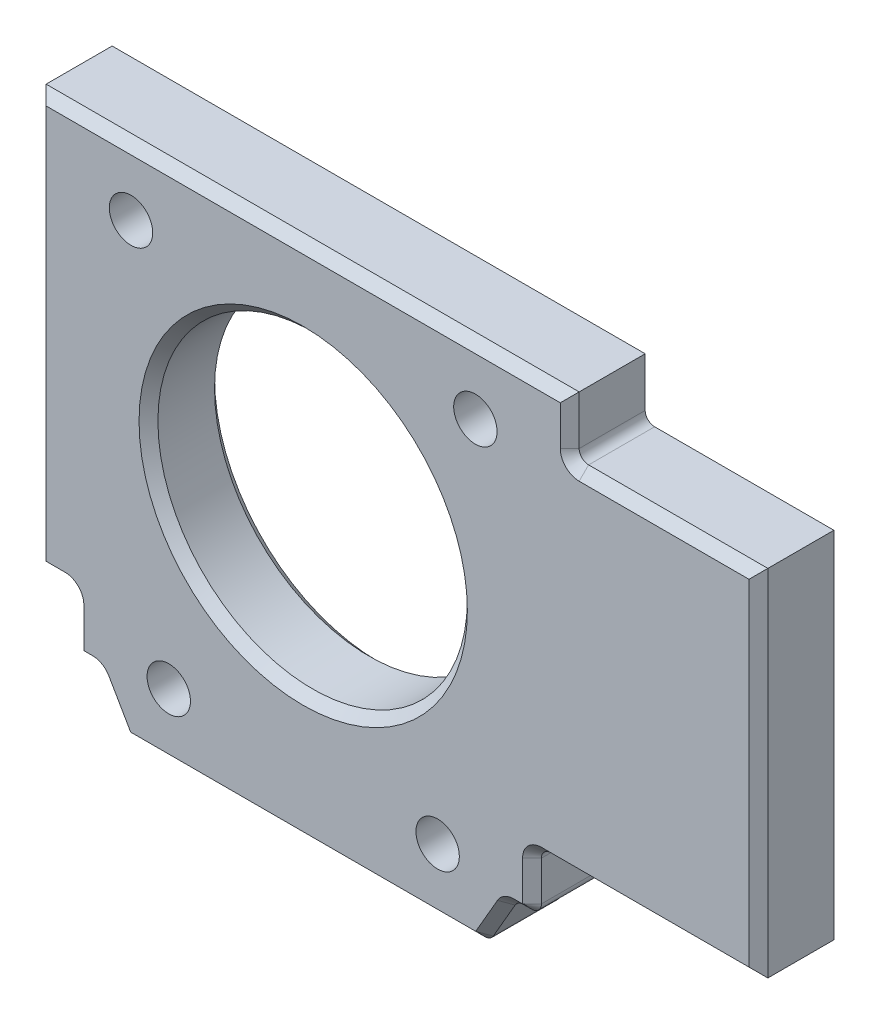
ISO-10303-21;
HEADER;
FILE_DESCRIPTION(('STEP AP214'),'2;1');
FILE_NAME('part.step','',(''),(''),'','','');
FILE_SCHEMA(('AUTOMOTIVE_DESIGN { 1 0 10303 214 1 1 1 1 }'));
ENDSEC;
DATA;
#1=APPLICATION_CONTEXT('core data for automotive mechanical design processes');
#2=APPLICATION_PROTOCOL_DEFINITION('international standard','automotive_design',2000,#1);
#3=PRODUCT_CONTEXT('',#1,'mechanical');
#4=PRODUCT('Part','Part','',(#3));
#5=PRODUCT_RELATED_PRODUCT_CATEGORY('part','',(#4));
#6=PRODUCT_DEFINITION_FORMATION('','',#4);
#7=PRODUCT_DEFINITION_CONTEXT('part definition',#1,'design');
#8=PRODUCT_DEFINITION('design','',#6,#7);
#9=PRODUCT_DEFINITION_SHAPE('','',#8);
#10=(LENGTH_UNIT() NAMED_UNIT(*) SI_UNIT(.MILLI.,.METRE.));
#11=(NAMED_UNIT(*) PLANE_ANGLE_UNIT() SI_UNIT($,.RADIAN.));
#12=(NAMED_UNIT(*) SI_UNIT($,.STERADIAN.) SOLID_ANGLE_UNIT());
#13=UNCERTAINTY_MEASURE_WITH_UNIT(LENGTH_MEASURE(1.E-05),#10,'distance_accuracy_value','');
#14=(GEOMETRIC_REPRESENTATION_CONTEXT(3) GLOBAL_UNCERTAINTY_ASSIGNED_CONTEXT((#13)) GLOBAL_UNIT_ASSIGNED_CONTEXT((#10,
#11,#12)) REPRESENTATION_CONTEXT('',''));
#15=CARTESIAN_POINT('',(0.,0.,0.));
#16=DIRECTION('',(0.,0.,1.));
#17=DIRECTION('',(1.,0.,0.));
#18=AXIS2_PLACEMENT_3D('',#15,#16,#17);
#19=CARTESIAN_POINT('',(-38.,-39.1799085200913,4.));
#20=DIRECTION('',(0.,0.,1.));
#21=DIRECTION('',(1.,0.,0.));
#22=AXIS2_PLACEMENT_3D('',#19,#20,#21);
#23=PLANE('',#22);
#24=CARTESIAN_POINT('',(-17.25,-41.7799085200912,4.));
#25=DIRECTION('',(0.,0.,1.));
#26=DIRECTION('',(1.,0.,0.));
#27=AXIS2_PLACEMENT_3D('',#24,#25,#26);
#28=CIRCLE('',#27,1.15000000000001);
#29=CARTESIAN_POINT('',(-16.1,-41.7799085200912,4.));
#30=VERTEX_POINT('',#29);
#31=EDGE_CURVE('E1416',#30,#30,#28,.T.);
#32=ORIENTED_EDGE('',*,*,#31,.F.);
#33=EDGE_LOOP('',(#32));
#34=FACE_BOUND('',#33,.T.);
#35=CARTESIAN_POINT('',(-31.5,-41.7799085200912,4.));
#36=DIRECTION('',(0.,0.,1.));
#37=DIRECTION('',(1.,0.,0.));
#38=AXIS2_PLACEMENT_3D('',#35,#36,#37);
#39=CIRCLE('',#38,1.14999999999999);
#40=CARTESIAN_POINT('',(-30.35,-41.7799085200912,4.));
#41=VERTEX_POINT('',#40);
#42=EDGE_CURVE('E1420',#41,#41,#39,.T.);
#43=ORIENTED_EDGE('',*,*,#42,.F.);
#44=EDGE_LOOP('',(#43));
#45=FACE_BOUND('',#44,.T.);
#46=CARTESIAN_POINT('',(-33.5,-21.2799085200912,4.));
#47=DIRECTION('',(0.,0.,1.));
#48=DIRECTION('',(1.,0.,0.));
#49=AXIS2_PLACEMENT_3D('',#46,#47,#48);
#50=CIRCLE('',#49,1.15);
#51=CARTESIAN_POINT('',(-32.35,-21.2799085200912,4.));
#52=VERTEX_POINT('',#51);
#53=EDGE_CURVE('E1428',#52,#52,#50,.T.);
#54=ORIENTED_EDGE('',*,*,#53,.F.);
#55=EDGE_LOOP('',(#54));
#56=FACE_BOUND('',#55,.T.);
#57=CARTESIAN_POINT('',(-15.25,-21.2799085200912,4.));
#58=DIRECTION('',(0.,0.,1.));
#59=DIRECTION('',(1.,0.,0.));
#60=AXIS2_PLACEMENT_3D('',#57,#58,#59);
#61=CIRCLE('',#60,1.15000000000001);
#62=CARTESIAN_POINT('',(-14.1,-21.2799085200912,4.));
#63=VERTEX_POINT('',#62);
#64=EDGE_CURVE('E289',#63,#63,#61,.T.);
#65=ORIENTED_EDGE('',*,*,#64,.F.);
#66=EDGE_LOOP('',(#65));
#67=FACE_BOUND('',#66,.T.);
#68=CARTESIAN_POINT('',(-24.375,-30.2799085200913,4.));
#69=DIRECTION('',(0.,0.,1.));
#70=DIRECTION('',(1.,0.,0.));
#71=AXIS2_PLACEMENT_3D('',#68,#69,#70);
#72=CIRCLE('',#71,8.70000000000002);
#73=CARTESIAN_POINT('',(-15.675,-30.2799085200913,4.));
#74=VERTEX_POINT('',#73);
#75=EDGE_CURVE('E443',#74,#74,#72,.F.);
#76=ORIENTED_EDGE('',*,*,#75,.T.);
#77=EDGE_LOOP('',(#76));
#78=FACE_BOUND('',#77,.T.);
#79=CARTESIAN_POINT('',(-9.75,-20.3799085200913,4.));
#80=DIRECTION('',(0.,0.,1.));
#81=DIRECTION('',(1.,0.,0.));
#82=AXIS2_PLACEMENT_3D('',#79,#80,#81);
#83=CIRCLE('',#82,1.);
#84=CARTESIAN_POINT('',(-9.75,-21.3799085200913,4.));
#85=VERTEX_POINT('',#84);
#86=CARTESIAN_POINT('',(-10.75,-20.3799085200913,4.));
#87=VERTEX_POINT('',#86);
#88=EDGE_CURVE('E438',#85,#87,#83,.F.);
#89=ORIENTED_EDGE('',*,*,#88,.T.);
#90=DIRECTION('',(0.,1.,0.));
#91=VECTOR('',#90,1.);
#92=CARTESIAN_POINT('',(-10.75,-17.7799085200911,4.));
#93=LINE('',#92,#91);
#94=CARTESIAN_POINT('',(-10.75,-18.2799085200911,4.));
#95=VERTEX_POINT('',#94);
#96=EDGE_CURVE('E440',#87,#95,#93,.T.);
#97=ORIENTED_EDGE('',*,*,#96,.T.);
#98=DIRECTION('',(-1.,0.,0.));
#99=VECTOR('',#98,1.);
#100=CARTESIAN_POINT('',(-38.5,-18.2799085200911,4.));
#101=LINE('',#100,#99);
#102=CARTESIAN_POINT('',(-38.,-18.2799085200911,4.));
#103=VERTEX_POINT('',#102);
#104=EDGE_CURVE('E404',#95,#103,#101,.T.);
#105=ORIENTED_EDGE('',*,*,#104,.T.);
#106=DIRECTION('',(0.,-1.,0.));
#107=VECTOR('',#106,1.);
#108=CARTESIAN_POINT('',(-38.,-39.1799085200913,4.));
#109=LINE('',#108,#107);
#110=CARTESIAN_POINT('',(-38.,-39.1799085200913,4.));
#111=VERTEX_POINT('',#110);
#112=EDGE_CURVE('E406',#103,#111,#109,.T.);
#113=ORIENTED_EDGE('',*,*,#112,.T.);
#114=DIRECTION('',(1.,0.,0.));
#115=VECTOR('',#114,1.);
#116=CARTESIAN_POINT('',(-37.,-39.1799085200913,4.));
#117=LINE('',#116,#115);
#118=CARTESIAN_POINT('',(-37.,-39.1799085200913,4.));
#119=VERTEX_POINT('',#118);
#120=EDGE_CURVE('E408',#111,#119,#117,.T.);
#121=ORIENTED_EDGE('',*,*,#120,.T.);
#122=CARTESIAN_POINT('',(-37.,-40.1799085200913,4.));
#123=DIRECTION('',(0.,0.,1.));
#124=DIRECTION('',(1.,0.,0.));
#125=AXIS2_PLACEMENT_3D('',#122,#123,#124);
#126=CIRCLE('',#125,1.);
#127=CARTESIAN_POINT('',(-36.,-40.1799085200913,4.));
#128=VERTEX_POINT('',#127);
#129=EDGE_CURVE('E410',#119,#128,#126,.F.);
#130=ORIENTED_EDGE('',*,*,#129,.T.);
#131=DIRECTION('',(0.,-1.,0.));
#132=VECTOR('',#131,1.);
#133=CARTESIAN_POINT('',(-36.,-42.2799085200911,4.));
#134=LINE('',#133,#132);
#135=CARTESIAN_POINT('',(-36.,-42.2799085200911,4.));
#136=VERTEX_POINT('',#135);
#137=EDGE_CURVE('E412',#128,#136,#134,.T.);
#138=ORIENTED_EDGE('',*,*,#137,.T.);
#139=DIRECTION('',(1.,0.,0.));
#140=VECTOR('',#139,1.);
#141=CARTESIAN_POINT('',(-35.5386751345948,-42.2799085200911,4.));
#142=LINE('',#141,#140);
#143=CARTESIAN_POINT('',(-35.5386751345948,-42.2799085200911,4.));
#144=VERTEX_POINT('',#143);
#145=EDGE_CURVE('E414',#136,#144,#142,.T.);
#146=ORIENTED_EDGE('',*,*,#145,.T.);
#147=CARTESIAN_POINT('',(-35.5386751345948,-43.2799085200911,4.));
#148=DIRECTION('',(0.,0.,1.));
#149=DIRECTION('',(1.,0.,0.));
#150=AXIS2_PLACEMENT_3D('',#147,#148,#149);
#151=CIRCLE('',#150,1.00000000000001);
#152=CARTESIAN_POINT('',(-34.6726497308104,-42.7799085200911,4.));
#153=VERTEX_POINT('',#152);
#154=EDGE_CURVE('E416',#144,#153,#151,.F.);
#155=ORIENTED_EDGE('',*,*,#154,.T.);
#156=DIRECTION('',(0.500000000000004,-0.866025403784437,0.));
#157=VECTOR('',#156,1.);
#158=CARTESIAN_POINT('',(-33.5179491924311,-44.7799085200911,4.));
#159=LINE('',#158,#157);
#160=CARTESIAN_POINT('',(-33.5179491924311,-44.7799085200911,4.));
#161=VERTEX_POINT('',#160);
#162=EDGE_CURVE('E418',#153,#161,#159,.T.);
#163=ORIENTED_EDGE('',*,*,#162,.T.);
#164=DIRECTION('',(1.,0.,0.));
#165=VECTOR('',#164,1.);
#166=CARTESIAN_POINT('',(-15.2320508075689,-44.7799085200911,4.));
#167=LINE('',#166,#165);
#168=CARTESIAN_POINT('',(-15.2320508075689,-44.7799085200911,4.));
#169=VERTEX_POINT('',#168);
#170=EDGE_CURVE('E420',#161,#169,#167,.T.);
#171=ORIENTED_EDGE('',*,*,#170,.T.);
#172=DIRECTION('',(0.499999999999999,0.866025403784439,0.));
#173=VECTOR('',#172,1.);
#174=CARTESIAN_POINT('',(-14.0773502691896,-42.7799085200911,4.));
#175=LINE('',#174,#173);
#176=CARTESIAN_POINT('',(-14.0773502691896,-42.7799085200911,4.));
#177=VERTEX_POINT('',#176);
#178=EDGE_CURVE('E422',#169,#177,#175,.T.);
#179=ORIENTED_EDGE('',*,*,#178,.T.);
#180=CARTESIAN_POINT('',(-13.2113248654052,-43.2799085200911,4.));
#181=DIRECTION('',(0.,0.,1.));
#182=DIRECTION('',(1.,0.,0.));
#183=AXIS2_PLACEMENT_3D('',#180,#181,#182);
#184=CIRCLE('',#183,1.);
#185=CARTESIAN_POINT('',(-13.2113248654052,-42.2799085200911,4.));
#186=VERTEX_POINT('',#185);
#187=EDGE_CURVE('E424',#177,#186,#184,.F.);
#188=ORIENTED_EDGE('',*,*,#187,.T.);
#189=DIRECTION('',(1.,0.,0.));
#190=VECTOR('',#189,1.);
#191=CARTESIAN_POINT('',(-12.75,-42.2799085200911,4.));
#192=LINE('',#191,#190);
#193=CARTESIAN_POINT('',(-12.75,-42.2799085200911,4.));
#194=VERTEX_POINT('',#193);
#195=EDGE_CURVE('E426',#186,#194,#192,.T.);
#196=ORIENTED_EDGE('',*,*,#195,.T.);
#197=DIRECTION('',(0.,1.,0.));
#198=VECTOR('',#197,1.);
#199=CARTESIAN_POINT('',(-12.75,-40.1799085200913,4.));
#200=LINE('',#199,#198);
#201=CARTESIAN_POINT('',(-12.75,-40.1799085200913,4.));
#202=VERTEX_POINT('',#201);
#203=EDGE_CURVE('E428',#194,#202,#200,.T.);
#204=ORIENTED_EDGE('',*,*,#203,.T.);
#205=CARTESIAN_POINT('',(-11.75,-40.1799085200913,4.));
#206=DIRECTION('',(0.,0.,1.));
#207=DIRECTION('',(1.,0.,0.));
#208=AXIS2_PLACEMENT_3D('',#205,#206,#207);
#209=CIRCLE('',#208,1.);
#210=CARTESIAN_POINT('',(-11.75,-39.1799085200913,4.));
#211=VERTEX_POINT('',#210);
#212=EDGE_CURVE('E430',#202,#211,#209,.F.);
#213=ORIENTED_EDGE('',*,*,#212,.T.);
#214=DIRECTION('',(1.,0.,0.));
#215=VECTOR('',#214,1.);
#216=CARTESIAN_POINT('',(-0.249999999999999,-39.1799085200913,4.));
#217=LINE('',#216,#215);
#218=CARTESIAN_POINT('',(-0.750000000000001,-39.1799085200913,4.));
#219=VERTEX_POINT('',#218);
#220=EDGE_CURVE('E432',#211,#219,#217,.T.);
#221=ORIENTED_EDGE('',*,*,#220,.T.);
#222=DIRECTION('',(0.,1.,0.));
#223=VECTOR('',#222,1.);
#224=CARTESIAN_POINT('',(-0.750000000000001,-20.8799085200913,4.));
#225=LINE('',#224,#223);
#226=CARTESIAN_POINT('',(-0.750000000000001,-21.3799085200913,4.));
#227=VERTEX_POINT('',#226);
#228=EDGE_CURVE('E434',#219,#227,#225,.T.);
#229=ORIENTED_EDGE('',*,*,#228,.T.);
#230=DIRECTION('',(-1.,0.,0.));
#231=VECTOR('',#230,1.);
#232=CARTESIAN_POINT('',(-9.75,-21.3799085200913,4.));
#233=LINE('',#232,#231);
#234=EDGE_CURVE('E436',#227,#85,#233,.T.);
#235=ORIENTED_EDGE('',*,*,#234,.T.);
#236=EDGE_LOOP('',(#89,#97,#105,#113,#121,#130,#138,#146,#155,#163,#171,#179,#188,#196,#204,
#213,#221,#229,#235));
#237=FACE_BOUND('',#236,.T.);
#238=ADVANCED_FACE('F41',(#34,#45,#56,#67,#78,#237),#23,.T.);
#239=CARTESIAN_POINT('',(-38.,-39.1799085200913,0.));
#240=DIRECTION('',(0.,0.,1.));
#241=DIRECTION('',(1.,0.,0.));
#242=AXIS2_PLACEMENT_3D('',#239,#240,#241);
#243=PLANE('',#242);
#244=CARTESIAN_POINT('',(-17.25,-41.7799085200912,0.));
#245=DIRECTION('',(0.,0.,1.));
#246=DIRECTION('',(1.,0.,0.));
#247=AXIS2_PLACEMENT_3D('',#244,#245,#246);
#248=CIRCLE('',#247,1.15000000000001);
#249=CARTESIAN_POINT('',(-16.1,-41.7799085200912,0.));
#250=VERTEX_POINT('',#249);
#251=EDGE_CURVE('E1414',#250,#250,#248,.T.);
#252=ORIENTED_EDGE('',*,*,#251,.T.);
#253=EDGE_LOOP('',(#252));
#254=FACE_BOUND('',#253,.T.);
#255=CARTESIAN_POINT('',(-31.5,-41.7799085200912,0.));
#256=DIRECTION('',(0.,0.,1.));
#257=DIRECTION('',(1.,0.,0.));
#258=AXIS2_PLACEMENT_3D('',#255,#256,#257);
#259=CIRCLE('',#258,1.14999999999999);
#260=CARTESIAN_POINT('',(-30.35,-41.7799085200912,0.));
#261=VERTEX_POINT('',#260);
#262=EDGE_CURVE('E1417',#261,#261,#259,.T.);
#263=ORIENTED_EDGE('',*,*,#262,.T.);
#264=EDGE_LOOP('',(#263));
#265=FACE_BOUND('',#264,.T.);
#266=CARTESIAN_POINT('',(-33.5,-21.2799085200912,0.));
#267=DIRECTION('',(0.,0.,1.));
#268=DIRECTION('',(1.,0.,0.));
#269=AXIS2_PLACEMENT_3D('',#266,#267,#268);
#270=CIRCLE('',#269,1.15);
#271=CARTESIAN_POINT('',(-32.35,-21.2799085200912,0.));
#272=VERTEX_POINT('',#271);
#273=EDGE_CURVE('E1432',#272,#272,#270,.T.);
#274=ORIENTED_EDGE('',*,*,#273,.T.);
#275=EDGE_LOOP('',(#274));
#276=FACE_BOUND('',#275,.T.);
#277=CARTESIAN_POINT('',(-15.25,-21.2799085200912,0.));
#278=DIRECTION('',(0.,0.,1.));
#279=DIRECTION('',(1.,0.,0.));
#280=AXIS2_PLACEMENT_3D('',#277,#278,#279);
#281=CIRCLE('',#280,1.15000000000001);
#282=CARTESIAN_POINT('',(-14.1,-21.2799085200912,0.));
#283=VERTEX_POINT('',#282);
#284=EDGE_CURVE('E495',#283,#283,#281,.T.);
#285=ORIENTED_EDGE('',*,*,#284,.T.);
#286=EDGE_LOOP('',(#285));
#287=FACE_BOUND('',#286,.T.);
#288=CARTESIAN_POINT('',(-24.375,-30.2799085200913,0.));
#289=DIRECTION('',(0.,0.,1.));
#290=DIRECTION('',(1.,0.,0.));
#291=AXIS2_PLACEMENT_3D('',#288,#289,#290);
#292=CIRCLE('',#291,8.7);
#293=CARTESIAN_POINT('',(-15.675,-30.2799085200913,0.));
#294=VERTEX_POINT('',#293);
#295=EDGE_CURVE('E11',#294,#294,#292,.T.);
#296=ORIENTED_EDGE('',*,*,#295,.T.);
#297=EDGE_LOOP('',(#296));
#298=FACE_BOUND('',#297,.T.);
#299=DIRECTION('',(-1.,0.,0.));
#300=VECTOR('',#299,1.);
#301=CARTESIAN_POINT('',(-10.25,-17.7799085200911,0.));
#302=LINE('',#301,#300);
#303=CARTESIAN_POINT('',(-10.25,-17.7799085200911,0.));
#304=VERTEX_POINT('',#303);
#305=CARTESIAN_POINT('',(-38.5,-17.7799085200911,0.));
#306=VERTEX_POINT('',#305);
#307=EDGE_CURVE('E276',#304,#306,#302,.T.);
#308=ORIENTED_EDGE('',*,*,#307,.F.);
#309=DIRECTION('',(0.,1.,0.));
#310=VECTOR('',#309,1.);
#311=CARTESIAN_POINT('',(-10.25,-20.3799085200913,0.));
#312=LINE('',#311,#310);
#313=CARTESIAN_POINT('',(-10.25,-20.3799085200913,0.));
#314=VERTEX_POINT('',#313);
#315=EDGE_CURVE('E353',#314,#304,#312,.T.);
#316=ORIENTED_EDGE('',*,*,#315,.F.);
#317=CARTESIAN_POINT('',(-9.75,-20.3799085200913,0.));
#318=DIRECTION('',(0.,0.,-1.));
#319=DIRECTION('',(1.,0.,0.));
#320=AXIS2_PLACEMENT_3D('',#317,#318,#319);
#321=CIRCLE('',#320,0.500000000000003);
#322=CARTESIAN_POINT('',(-9.75,-20.8799085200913,0.));
#323=VERTEX_POINT('',#322);
#324=EDGE_CURVE('E350',#323,#314,#321,.T.);
#325=ORIENTED_EDGE('',*,*,#324,.F.);
#326=DIRECTION('',(-1.,0.,0.));
#327=VECTOR('',#326,1.);
#328=CARTESIAN_POINT('',(-0.249999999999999,-20.8799085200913,0.));
#329=LINE('',#328,#327);
#330=CARTESIAN_POINT('',(-0.249999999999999,-20.8799085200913,0.));
#331=VERTEX_POINT('',#330);
#332=EDGE_CURVE('E347',#331,#323,#329,.T.);
#333=ORIENTED_EDGE('',*,*,#332,.F.);
#334=DIRECTION('',(0.,1.,0.));
#335=VECTOR('',#334,1.);
#336=CARTESIAN_POINT('',(-0.249999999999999,-39.6799085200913,0.));
#337=LINE('',#336,#335);
#338=CARTESIAN_POINT('',(-0.249999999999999,-39.6799085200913,0.));
#339=VERTEX_POINT('',#338);
#340=EDGE_CURVE('E344',#339,#331,#337,.T.);
#341=ORIENTED_EDGE('',*,*,#340,.F.);
#342=DIRECTION('',(1.,0.,0.));
#343=VECTOR('',#342,1.);
#344=CARTESIAN_POINT('',(-11.75,-39.6799085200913,0.));
#345=LINE('',#344,#343);
#346=CARTESIAN_POINT('',(-11.75,-39.6799085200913,0.));
#347=VERTEX_POINT('',#346);
#348=EDGE_CURVE('E341',#347,#339,#345,.T.);
#349=ORIENTED_EDGE('',*,*,#348,.F.);
#350=CARTESIAN_POINT('',(-11.75,-40.1799085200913,0.));
#351=DIRECTION('',(0.,0.,-1.));
#352=DIRECTION('',(1.,0.,0.));
#353=AXIS2_PLACEMENT_3D('',#350,#351,#352);
#354=CIRCLE('',#353,0.5);
#355=CARTESIAN_POINT('',(-12.25,-40.1799085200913,0.));
#356=VERTEX_POINT('',#355);
#357=EDGE_CURVE('E338',#356,#347,#354,.T.);
#358=ORIENTED_EDGE('',*,*,#357,.F.);
#359=DIRECTION('',(0.,1.,0.));
#360=VECTOR('',#359,1.);
#361=CARTESIAN_POINT('',(-12.25,-42.2799085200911,0.));
#362=LINE('',#361,#360);
#363=CARTESIAN_POINT('',(-12.25,-42.2799085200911,0.));
#364=VERTEX_POINT('',#363);
#365=EDGE_CURVE('E335',#364,#356,#362,.T.);
#366=ORIENTED_EDGE('',*,*,#365,.F.);
#367=CARTESIAN_POINT('',(-12.75,-42.2799085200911,0.));
#368=DIRECTION('',(0.,0.,1.));
#369=DIRECTION('',(1.,0.,0.));
#370=AXIS2_PLACEMENT_3D('',#367,#368,#369);
#371=CIRCLE('',#370,0.500000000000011);
#372=CARTESIAN_POINT('',(-12.75,-42.7799085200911,0.));
#373=VERTEX_POINT('',#372);
#374=EDGE_CURVE('E332',#373,#364,#371,.T.);
#375=ORIENTED_EDGE('',*,*,#374,.F.);
#376=DIRECTION('',(1.,0.,0.));
#377=VECTOR('',#376,1.);
#378=CARTESIAN_POINT('',(-13.2113248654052,-42.7799085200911,0.));
#379=LINE('',#378,#377);
#380=CARTESIAN_POINT('',(-13.2113248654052,-42.7799085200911,0.));
#381=VERTEX_POINT('',#380);
#382=EDGE_CURVE('E329',#381,#373,#379,.T.);
#383=ORIENTED_EDGE('',*,*,#382,.F.);
#384=CARTESIAN_POINT('',(-13.2113248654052,-43.2799085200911,0.));
#385=DIRECTION('',(0.,0.,-1.));
#386=DIRECTION('',(1.,0.,0.));
#387=AXIS2_PLACEMENT_3D('',#384,#385,#386);
#388=CIRCLE('',#387,0.500000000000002);
#389=CARTESIAN_POINT('',(-13.6443375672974,-43.0299085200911,0.));
#390=VERTEX_POINT('',#389);
#391=EDGE_CURVE('E326',#390,#381,#388,.T.);
#392=ORIENTED_EDGE('',*,*,#391,.F.);
#393=DIRECTION('',(0.499999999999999,0.866025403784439,0.));
#394=VECTOR('',#393,1.);
#395=CARTESIAN_POINT('',(-14.7990381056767,-45.0299085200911,0.));
#396=LINE('',#395,#394);
#397=CARTESIAN_POINT('',(-14.7990381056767,-45.0299085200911,0.));
#398=VERTEX_POINT('',#397);
#399=EDGE_CURVE('E323',#398,#390,#396,.T.);
#400=ORIENTED_EDGE('',*,*,#399,.F.);
#401=CARTESIAN_POINT('',(-15.2320508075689,-44.7799085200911,0.));
#402=DIRECTION('',(0.,0.,1.));
#403=DIRECTION('',(1.,0.,0.));
#404=AXIS2_PLACEMENT_3D('',#401,#402,#403);
#405=CIRCLE('',#404,0.500000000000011);
#406=CARTESIAN_POINT('',(-15.2320508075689,-45.2799085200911,0.));
#407=VERTEX_POINT('',#406);
#408=EDGE_CURVE('E320',#407,#398,#405,.T.);
#409=ORIENTED_EDGE('',*,*,#408,.F.);
#410=DIRECTION('',(1.,0.,0.));
#411=VECTOR('',#410,1.);
#412=CARTESIAN_POINT('',(-33.5179491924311,-45.2799085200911,0.));
#413=LINE('',#412,#411);
#414=CARTESIAN_POINT('',(-33.5179491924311,-45.2799085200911,0.));
#415=VERTEX_POINT('',#414);
#416=EDGE_CURVE('E317',#415,#407,#413,.T.);
#417=ORIENTED_EDGE('',*,*,#416,.F.);
#418=CARTESIAN_POINT('',(-33.5179491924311,-44.7799085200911,0.));
#419=DIRECTION('',(0.,0.,1.));
#420=DIRECTION('',(1.,0.,0.));
#421=AXIS2_PLACEMENT_3D('',#418,#419,#420);
#422=CIRCLE('',#421,0.500000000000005);
#423=CARTESIAN_POINT('',(-33.9509618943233,-45.0299085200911,0.));
#424=VERTEX_POINT('',#423);
#425=EDGE_CURVE('E314',#424,#415,#422,.T.);
#426=ORIENTED_EDGE('',*,*,#425,.F.);
#427=DIRECTION('',(0.500000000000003,-0.866025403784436,0.));
#428=VECTOR('',#427,1.);
#429=CARTESIAN_POINT('',(-35.1056624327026,-43.0299085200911,0.));
#430=LINE('',#429,#428);
#431=CARTESIAN_POINT('',(-35.1056624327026,-43.0299085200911,0.));
#432=VERTEX_POINT('',#431);
#433=EDGE_CURVE('E311',#432,#424,#430,.T.);
#434=ORIENTED_EDGE('',*,*,#433,.F.);
#435=CARTESIAN_POINT('',(-35.5386751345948,-43.2799085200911,0.));
#436=DIRECTION('',(0.,0.,-1.));
#437=DIRECTION('',(1.,0.,0.));
#438=AXIS2_PLACEMENT_3D('',#435,#436,#437);
#439=CIRCLE('',#438,0.500000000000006);
#440=CARTESIAN_POINT('',(-35.5386751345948,-42.7799085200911,0.));
#441=VERTEX_POINT('',#440);
#442=EDGE_CURVE('E308',#441,#432,#439,.T.);
#443=ORIENTED_EDGE('',*,*,#442,.F.);
#444=DIRECTION('',(1.,0.,0.));
#445=VECTOR('',#444,1.);
#446=CARTESIAN_POINT('',(-36.,-42.7799085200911,0.));
#447=LINE('',#446,#445);
#448=CARTESIAN_POINT('',(-36.,-42.7799085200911,0.));
#449=VERTEX_POINT('',#448);
#450=EDGE_CURVE('E305',#449,#441,#447,.T.);
#451=ORIENTED_EDGE('',*,*,#450,.F.);
#452=CARTESIAN_POINT('',(-36.,-42.2799085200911,0.));
#453=DIRECTION('',(0.,0.,1.));
#454=DIRECTION('',(1.,0.,0.));
#455=AXIS2_PLACEMENT_3D('',#452,#453,#454);
#456=CIRCLE('',#455,0.500000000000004);
#457=CARTESIAN_POINT('',(-36.5,-42.2799085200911,0.));
#458=VERTEX_POINT('',#457);
#459=EDGE_CURVE('E302',#458,#449,#456,.T.);
#460=ORIENTED_EDGE('',*,*,#459,.F.);
#461=DIRECTION('',(0.,-1.,0.));
#462=VECTOR('',#461,1.);
#463=CARTESIAN_POINT('',(-36.5,-40.1799085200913,0.));
#464=LINE('',#463,#462);
#465=CARTESIAN_POINT('',(-36.5,-40.1799085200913,0.));
#466=VERTEX_POINT('',#465);
#467=EDGE_CURVE('E299',#466,#458,#464,.T.);
#468=ORIENTED_EDGE('',*,*,#467,.F.);
#469=CARTESIAN_POINT('',(-37.,-40.1799085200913,0.));
#470=DIRECTION('',(0.,0.,-1.));
#471=DIRECTION('',(1.,0.,0.));
#472=AXIS2_PLACEMENT_3D('',#469,#470,#471);
#473=CIRCLE('',#472,0.5);
#474=CARTESIAN_POINT('',(-37.,-39.6799085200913,0.));
#475=VERTEX_POINT('',#474);
#476=EDGE_CURVE('E296',#475,#466,#473,.T.);
#477=ORIENTED_EDGE('',*,*,#476,.F.);
#478=DIRECTION('',(1.,0.,0.));
#479=VECTOR('',#478,1.);
#480=CARTESIAN_POINT('',(-38.,-39.6799085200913,0.));
#481=LINE('',#480,#479);
#482=CARTESIAN_POINT('',(-38.,-39.6799085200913,0.));
#483=VERTEX_POINT('',#482);
#484=EDGE_CURVE('E293',#483,#475,#481,.T.);
#485=ORIENTED_EDGE('',*,*,#484,.F.);
#486=CARTESIAN_POINT('',(-38.,-39.1799085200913,0.));
#487=DIRECTION('',(0.,0.,1.));
#488=DIRECTION('',(1.,0.,0.));
#489=AXIS2_PLACEMENT_3D('',#486,#487,#488);
#490=CIRCLE('',#489,0.499999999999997);
#491=CARTESIAN_POINT('',(-38.5,-39.1799085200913,0.));
#492=VERTEX_POINT('',#491);
#493=EDGE_CURVE('E279',#492,#483,#490,.T.);
#494=ORIENTED_EDGE('',*,*,#493,.F.);
#495=DIRECTION('',(0.,-1.,0.));
#496=VECTOR('',#495,1.);
#497=CARTESIAN_POINT('',(-38.5,-17.7799085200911,0.));
#498=LINE('',#497,#496);
#499=EDGE_CURVE('E264',#306,#492,#498,.T.);
#500=ORIENTED_EDGE('',*,*,#499,.F.);
#501=EDGE_LOOP('',(#308,#316,#325,#333,#341,#349,#358,#366,#375,#383,#392,#400,#409,#417,#426,
#434,#443,#451,#460,#468,#477,#485,#494,#500));
#502=FACE_BOUND('',#501,.T.);
#503=ADVANCED_FACE('F274',(#254,#265,#276,#287,#298,#502),#243,.F.);
#504=CARTESIAN_POINT('',(-10.25,-17.7799085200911,4.));
#505=DIRECTION('',(0.,-1.,0.));
#506=DIRECTION('',(0.,0.,-1.));
#507=AXIS2_PLACEMENT_3D('',#504,#505,#506);
#508=PLANE('',#507);
#509=DIRECTION('',(0.,0.,-1.));
#510=VECTOR('',#509,1.);
#511=CARTESIAN_POINT('',(-38.5,-17.7799085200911,4.));
#512=LINE('',#511,#510);
#513=CARTESIAN_POINT('',(-38.5,-17.7799085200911,3.5));
#514=VERTEX_POINT('',#513);
#515=EDGE_CURVE('E261',#514,#306,#512,.T.);
#516=ORIENTED_EDGE('',*,*,#515,.F.);
#517=DIRECTION('',(1.,0.,0.));
#518=VECTOR('',#517,1.);
#519=CARTESIAN_POINT('',(-10.25,-17.7799085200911,3.5));
#520=LINE('',#519,#518);
#521=CARTESIAN_POINT('',(-10.25,-17.7799085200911,3.5));
#522=VERTEX_POINT('',#521);
#523=EDGE_CURVE('E51',#514,#522,#520,.T.);
#524=ORIENTED_EDGE('',*,*,#523,.T.);
#525=DIRECTION('',(0.,0.,-1.));
#526=VECTOR('',#525,1.);
#527=CARTESIAN_POINT('',(-10.25,-17.7799085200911,4.));
#528=LINE('',#527,#526);
#529=EDGE_CURVE('E283',#522,#304,#528,.T.);
#530=ORIENTED_EDGE('',*,*,#529,.T.);
#531=ORIENTED_EDGE('',*,*,#307,.T.);
#532=EDGE_LOOP('',(#516,#524,#530,#531));
#533=FACE_BOUND('',#532,.T.);
#534=ADVANCED_FACE('F281',(#533),#508,.F.);
#535=CARTESIAN_POINT('',(-38.5,-17.7799085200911,4.));
#536=DIRECTION('',(1.,0.,0.));
#537=DIRECTION('',(0.,0.,-1.));
#538=AXIS2_PLACEMENT_3D('',#535,#536,#537);
#539=PLANE('',#538);
#540=DIRECTION('',(0.,0.,-1.));
#541=VECTOR('',#540,1.);
#542=CARTESIAN_POINT('',(-38.5,-39.1799085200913,4.));
#543=LINE('',#542,#541);
#544=CARTESIAN_POINT('',(-38.5,-39.1799085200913,3.5));
#545=VERTEX_POINT('',#544);
#546=EDGE_CURVE('E270',#545,#492,#543,.T.);
#547=ORIENTED_EDGE('',*,*,#546,.F.);
#548=DIRECTION('',(0.,1.,0.));
#549=VECTOR('',#548,1.);
#550=CARTESIAN_POINT('',(-38.5,-17.7799085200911,3.5));
#551=LINE('',#550,#549);
#552=EDGE_CURVE('E59',#545,#514,#551,.T.);
#553=ORIENTED_EDGE('',*,*,#552,.T.);
#554=ORIENTED_EDGE('',*,*,#515,.T.);
#555=ORIENTED_EDGE('',*,*,#499,.T.);
#556=EDGE_LOOP('',(#547,#553,#554,#555));
#557=FACE_BOUND('',#556,.T.);
#558=ADVANCED_FACE('F263',(#557),#539,.F.);
#559=CARTESIAN_POINT('',(-38.,-39.1799085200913,4.));
#560=DIRECTION('',(0.,0.,-1.));
#561=DIRECTION('',(-1.,0.,0.));
#562=AXIS2_PLACEMENT_3D('',#559,#560,#561);
#563=CYLINDRICAL_SURFACE('',#562,0.499999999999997);
#564=DIRECTION('',(0.,0.,-1.));
#565=VECTOR('',#564,1.);
#566=CARTESIAN_POINT('',(-38.,-39.6799085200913,4.));
#567=LINE('',#566,#565);
#568=CARTESIAN_POINT('',(-38.,-39.6799085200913,3.5));
#569=VERTEX_POINT('',#568);
#570=EDGE_CURVE('E396',#569,#483,#567,.T.);
#571=ORIENTED_EDGE('',*,*,#570,.F.);
#572=CARTESIAN_POINT('',(-38.,-39.1799085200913,3.5));
#573=DIRECTION('',(0.,0.,1.));
#574=DIRECTION('',(1.,0.,0.));
#575=AXIS2_PLACEMENT_3D('',#572,#573,#574);
#576=CIRCLE('',#575,0.499999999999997);
#577=EDGE_CURVE('E67',#569,#545,#576,.F.);
#578=ORIENTED_EDGE('',*,*,#577,.T.);
#579=ORIENTED_EDGE('',*,*,#546,.T.);
#580=ORIENTED_EDGE('',*,*,#493,.T.);
#581=EDGE_LOOP('',(#571,#578,#579,#580));
#582=FACE_BOUND('',#581,.T.);
#583=ADVANCED_FACE('F638',(#582),#563,.T.);
#584=CARTESIAN_POINT('',(-38.,-39.6799085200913,4.));
#585=DIRECTION('',(0.,1.,0.));
#586=DIRECTION('',(-1.,0.,0.));
#587=AXIS2_PLACEMENT_3D('',#584,#585,#586);
#588=PLANE('',#587);
#589=DIRECTION('',(0.,0.,-1.));
#590=VECTOR('',#589,1.);
#591=CARTESIAN_POINT('',(-37.,-39.6799085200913,4.));
#592=LINE('',#591,#590);
#593=CARTESIAN_POINT('',(-37.,-39.6799085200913,3.5));
#594=VERTEX_POINT('',#593);
#595=EDGE_CURVE('E394',#594,#475,#592,.T.);
#596=ORIENTED_EDGE('',*,*,#595,.F.);
#597=DIRECTION('',(-1.,0.,0.));
#598=VECTOR('',#597,1.);
#599=CARTESIAN_POINT('',(-38.,-39.6799085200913,3.5));
#600=LINE('',#599,#598);
#601=EDGE_CURVE('E487',#594,#569,#600,.T.);
#602=ORIENTED_EDGE('',*,*,#601,.T.);
#603=ORIENTED_EDGE('',*,*,#570,.T.);
#604=ORIENTED_EDGE('',*,*,#484,.T.);
#605=EDGE_LOOP('',(#596,#602,#603,#604));
#606=FACE_BOUND('',#605,.T.);
#607=ADVANCED_FACE('F635',(#606),#588,.F.);
#608=CARTESIAN_POINT('',(-37.,-40.1799085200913,4.));
#609=DIRECTION('',(0.,0.,-1.));
#610=DIRECTION('',(-1.,0.,0.));
#611=AXIS2_PLACEMENT_3D('',#608,#609,#610);
#612=CYLINDRICAL_SURFACE('',#611,0.5);
#613=DIRECTION('',(0.,0.,-1.));
#614=VECTOR('',#613,1.);
#615=CARTESIAN_POINT('',(-36.5,-40.1799085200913,4.));
#616=LINE('',#615,#614);
#617=CARTESIAN_POINT('',(-36.5,-40.1799085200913,3.5));
#618=VERTEX_POINT('',#617);
#619=EDGE_CURVE('E392',#618,#466,#616,.T.);
#620=ORIENTED_EDGE('',*,*,#619,.F.);
#621=CARTESIAN_POINT('',(-37.,-40.1799085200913,3.5));
#622=DIRECTION('',(0.,0.,1.));
#623=DIRECTION('',(1.,0.,0.));
#624=AXIS2_PLACEMENT_3D('',#621,#622,#623);
#625=CIRCLE('',#624,0.5);
#626=EDGE_CURVE('E485',#618,#594,#625,.T.);
#627=ORIENTED_EDGE('',*,*,#626,.T.);
#628=ORIENTED_EDGE('',*,*,#595,.T.);
#629=ORIENTED_EDGE('',*,*,#476,.T.);
#630=EDGE_LOOP('',(#620,#627,#628,#629));
#631=FACE_BOUND('',#630,.T.);
#632=ADVANCED_FACE('F630',(#631),#612,.F.);
#633=CARTESIAN_POINT('',(-36.5,-40.1799085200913,4.));
#634=DIRECTION('',(1.,0.,0.));
#635=DIRECTION('',(0.,1.,0.));
#636=AXIS2_PLACEMENT_3D('',#633,#634,#635);
#637=PLANE('',#636);
#638=DIRECTION('',(0.,0.,-1.));
#639=VECTOR('',#638,1.);
#640=CARTESIAN_POINT('',(-36.5,-42.2799085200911,4.));
#641=LINE('',#640,#639);
#642=CARTESIAN_POINT('',(-36.5,-42.2799085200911,3.5));
#643=VERTEX_POINT('',#642);
#644=EDGE_CURVE('E390',#643,#458,#641,.T.);
#645=ORIENTED_EDGE('',*,*,#644,.F.);
#646=DIRECTION('',(0.,1.,0.));
#647=VECTOR('',#646,1.);
#648=CARTESIAN_POINT('',(-36.5,-40.1799085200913,3.5));
#649=LINE('',#648,#647);
#650=EDGE_CURVE('E483',#643,#618,#649,.T.);
#651=ORIENTED_EDGE('',*,*,#650,.T.);
#652=ORIENTED_EDGE('',*,*,#619,.T.);
#653=ORIENTED_EDGE('',*,*,#467,.T.);
#654=EDGE_LOOP('',(#645,#651,#652,#653));
#655=FACE_BOUND('',#654,.T.);
#656=ADVANCED_FACE('F624',(#655),#637,.F.);
#657=CARTESIAN_POINT('',(-36.,-42.2799085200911,4.));
#658=DIRECTION('',(0.,0.,-1.));
#659=DIRECTION('',(-1.,0.,0.));
#660=AXIS2_PLACEMENT_3D('',#657,#658,#659);
#661=CYLINDRICAL_SURFACE('',#660,0.500000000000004);
#662=DIRECTION('',(0.,0.,-1.));
#663=VECTOR('',#662,1.);
#664=CARTESIAN_POINT('',(-36.,-42.7799085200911,4.));
#665=LINE('',#664,#663);
#666=CARTESIAN_POINT('',(-36.,-42.7799085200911,3.5));
#667=VERTEX_POINT('',#666);
#668=EDGE_CURVE('E388',#667,#449,#665,.T.);
#669=ORIENTED_EDGE('',*,*,#668,.F.);
#670=CARTESIAN_POINT('',(-36.,-42.2799085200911,3.5));
#671=DIRECTION('',(0.,0.,1.));
#672=DIRECTION('',(1.,0.,0.));
#673=AXIS2_PLACEMENT_3D('',#670,#671,#672);
#674=CIRCLE('',#673,0.500000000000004);
#675=EDGE_CURVE('E481',#667,#643,#674,.F.);
#676=ORIENTED_EDGE('',*,*,#675,.T.);
#677=ORIENTED_EDGE('',*,*,#644,.T.);
#678=ORIENTED_EDGE('',*,*,#459,.T.);
#679=EDGE_LOOP('',(#669,#676,#677,#678));
#680=FACE_BOUND('',#679,.T.);
#681=ADVANCED_FACE('F618',(#680),#661,.T.);
#682=CARTESIAN_POINT('',(-36.,-42.7799085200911,4.));
#683=DIRECTION('',(0.,1.,0.));
#684=DIRECTION('',(-1.,0.,0.));
#685=AXIS2_PLACEMENT_3D('',#682,#683,#684);
#686=PLANE('',#685);
#687=DIRECTION('',(0.,0.,-1.));
#688=VECTOR('',#687,1.);
#689=CARTESIAN_POINT('',(-35.5386751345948,-42.7799085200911,4.));
#690=LINE('',#689,#688);
#691=CARTESIAN_POINT('',(-35.5386751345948,-42.7799085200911,3.5));
#692=VERTEX_POINT('',#691);
#693=EDGE_CURVE('E386',#692,#441,#690,.T.);
#694=ORIENTED_EDGE('',*,*,#693,.F.);
#695=DIRECTION('',(-1.,0.,0.));
#696=VECTOR('',#695,1.);
#697=CARTESIAN_POINT('',(-36.,-42.7799085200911,3.5));
#698=LINE('',#697,#696);
#699=EDGE_CURVE('E479',#692,#667,#698,.T.);
#700=ORIENTED_EDGE('',*,*,#699,.T.);
#701=ORIENTED_EDGE('',*,*,#668,.T.);
#702=ORIENTED_EDGE('',*,*,#450,.T.);
#703=EDGE_LOOP('',(#694,#700,#701,#702));
#704=FACE_BOUND('',#703,.T.);
#705=ADVANCED_FACE('F616',(#704),#686,.F.);
#706=CARTESIAN_POINT('',(-35.5386751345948,-43.2799085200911,4.));
#707=DIRECTION('',(0.,0.,-1.));
#708=DIRECTION('',(-1.,0.,0.));
#709=AXIS2_PLACEMENT_3D('',#706,#707,#708);
#710=CYLINDRICAL_SURFACE('',#709,0.500000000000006);
#711=DIRECTION('',(0.,0.,-1.));
#712=VECTOR('',#711,1.);
#713=CARTESIAN_POINT('',(-35.1056624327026,-43.0299085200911,4.));
#714=LINE('',#713,#712);
#715=CARTESIAN_POINT('',(-35.1056624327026,-43.0299085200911,3.5));
#716=VERTEX_POINT('',#715);
#717=EDGE_CURVE('E384',#716,#432,#714,.T.);
#718=ORIENTED_EDGE('',*,*,#717,.F.);
#719=CARTESIAN_POINT('',(-35.5386751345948,-43.2799085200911,3.5));
#720=DIRECTION('',(0.,0.,1.));
#721=DIRECTION('',(1.,0.,0.));
#722=AXIS2_PLACEMENT_3D('',#719,#720,#721);
#723=CIRCLE('',#722,0.500000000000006);
#724=EDGE_CURVE('E477',#716,#692,#723,.T.);
#725=ORIENTED_EDGE('',*,*,#724,.T.);
#726=ORIENTED_EDGE('',*,*,#693,.T.);
#727=ORIENTED_EDGE('',*,*,#442,.T.);
#728=EDGE_LOOP('',(#718,#725,#726,#727));
#729=FACE_BOUND('',#728,.T.);
#730=ADVANCED_FACE('F576',(#729),#710,.F.);
#731=CARTESIAN_POINT('',(-35.1056624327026,-43.0299085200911,4.));
#732=DIRECTION('',(0.866025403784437,0.500000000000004,0.));
#733=DIRECTION('',(-0.500000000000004,0.866025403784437,0.));
#734=AXIS2_PLACEMENT_3D('',#731,#732,#733);
#735=PLANE('',#734);
#736=DIRECTION('',(0.,0.,-1.));
#737=VECTOR('',#736,1.);
#738=CARTESIAN_POINT('',(-33.9509618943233,-45.0299085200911,4.));
#739=LINE('',#738,#737);
#740=CARTESIAN_POINT('',(-33.9509618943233,-45.0299085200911,3.5));
#741=VERTEX_POINT('',#740);
#742=EDGE_CURVE('E382',#741,#424,#739,.T.);
#743=ORIENTED_EDGE('',*,*,#742,.F.);
#744=DIRECTION('',(-0.500000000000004,0.866025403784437,0.));
#745=VECTOR('',#744,1.);
#746=CARTESIAN_POINT('',(-35.1056624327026,-43.0299085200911,3.5));
#747=LINE('',#746,#745);
#748=EDGE_CURVE('E475',#741,#716,#747,.T.);
#749=ORIENTED_EDGE('',*,*,#748,.T.);
#750=ORIENTED_EDGE('',*,*,#717,.T.);
#751=ORIENTED_EDGE('',*,*,#433,.T.);
#752=EDGE_LOOP('',(#743,#749,#750,#751));
#753=FACE_BOUND('',#752,.T.);
#754=ADVANCED_FACE('F574',(#753),#735,.F.);
#755=CARTESIAN_POINT('',(-33.5179491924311,-44.7799085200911,4.));
#756=DIRECTION('',(0.,0.,-1.));
#757=DIRECTION('',(-1.,0.,0.));
#758=AXIS2_PLACEMENT_3D('',#755,#756,#757);
#759=CYLINDRICAL_SURFACE('',#758,0.500000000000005);
#760=DIRECTION('',(0.,0.,-1.));
#761=VECTOR('',#760,1.);
#762=CARTESIAN_POINT('',(-33.5179491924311,-45.2799085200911,4.));
#763=LINE('',#762,#761);
#764=CARTESIAN_POINT('',(-33.5179491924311,-45.2799085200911,3.5));
#765=VERTEX_POINT('',#764);
#766=EDGE_CURVE('E380',#765,#415,#763,.T.);
#767=ORIENTED_EDGE('',*,*,#766,.F.);
#768=CARTESIAN_POINT('',(-33.5179491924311,-44.7799085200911,3.5));
#769=DIRECTION('',(0.,0.,1.));
#770=DIRECTION('',(1.,0.,0.));
#771=AXIS2_PLACEMENT_3D('',#768,#769,#770);
#772=CIRCLE('',#771,0.500000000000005);
#773=EDGE_CURVE('E473',#765,#741,#772,.F.);
#774=ORIENTED_EDGE('',*,*,#773,.T.);
#775=ORIENTED_EDGE('',*,*,#742,.T.);
#776=ORIENTED_EDGE('',*,*,#425,.T.);
#777=EDGE_LOOP('',(#767,#774,#775,#776));
#778=FACE_BOUND('',#777,.T.);
#779=ADVANCED_FACE('F586',(#778),#759,.T.);
#780=CARTESIAN_POINT('',(-33.5179491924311,-45.2799085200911,4.));
#781=DIRECTION('',(0.,1.,0.));
#782=DIRECTION('',(0.,0.,1.));
#783=AXIS2_PLACEMENT_3D('',#780,#781,#782);
#784=PLANE('',#783);
#785=DIRECTION('',(0.,0.,-1.));
#786=VECTOR('',#785,1.);
#787=CARTESIAN_POINT('',(-15.2320508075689,-45.2799085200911,4.));
#788=LINE('',#787,#786);
#789=CARTESIAN_POINT('',(-15.2320508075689,-45.2799085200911,3.5));
#790=VERTEX_POINT('',#789);
#791=EDGE_CURVE('E378',#790,#407,#788,.T.);
#792=ORIENTED_EDGE('',*,*,#791,.F.);
#793=DIRECTION('',(-1.,0.,0.));
#794=VECTOR('',#793,1.);
#795=CARTESIAN_POINT('',(-33.5179491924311,-45.2799085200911,3.5));
#796=LINE('',#795,#794);
#797=EDGE_CURVE('E471',#790,#765,#796,.T.);
#798=ORIENTED_EDGE('',*,*,#797,.T.);
#799=ORIENTED_EDGE('',*,*,#766,.T.);
#800=ORIENTED_EDGE('',*,*,#416,.T.);
#801=EDGE_LOOP('',(#792,#798,#799,#800));
#802=FACE_BOUND('',#801,.T.);
#803=ADVANCED_FACE('F589',(#802),#784,.F.);
#804=CARTESIAN_POINT('',(-15.2320508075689,-44.7799085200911,4.));
#805=DIRECTION('',(0.,0.,-1.));
#806=DIRECTION('',(-1.,0.,0.));
#807=AXIS2_PLACEMENT_3D('',#804,#805,#806);
#808=CYLINDRICAL_SURFACE('',#807,0.500000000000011);
#809=DIRECTION('',(0.,0.,-1.));
#810=VECTOR('',#809,1.);
#811=CARTESIAN_POINT('',(-14.7990381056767,-45.0299085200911,4.));
#812=LINE('',#811,#810);
#813=CARTESIAN_POINT('',(-14.7990381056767,-45.0299085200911,3.5));
#814=VERTEX_POINT('',#813);
#815=EDGE_CURVE('E376',#814,#398,#812,.T.);
#816=ORIENTED_EDGE('',*,*,#815,.F.);
#817=CARTESIAN_POINT('',(-15.2320508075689,-44.7799085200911,3.5));
#818=DIRECTION('',(0.,0.,1.));
#819=DIRECTION('',(1.,0.,0.));
#820=AXIS2_PLACEMENT_3D('',#817,#818,#819);
#821=CIRCLE('',#820,0.500000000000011);
#822=EDGE_CURVE('E469',#814,#790,#821,.F.);
#823=ORIENTED_EDGE('',*,*,#822,.T.);
#824=ORIENTED_EDGE('',*,*,#791,.T.);
#825=ORIENTED_EDGE('',*,*,#408,.T.);
#826=EDGE_LOOP('',(#816,#823,#824,#825));
#827=FACE_BOUND('',#826,.T.);
#828=ADVANCED_FACE('F740',(#827),#808,.T.);
#829=CARTESIAN_POINT('',(-14.7990381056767,-45.0299085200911,4.));
#830=DIRECTION('',(-0.866025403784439,0.499999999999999,0.));
#831=DIRECTION('',(-0.499999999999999,-0.866025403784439,0.));
#832=AXIS2_PLACEMENT_3D('',#829,#830,#831);
#833=PLANE('',#832);
#834=DIRECTION('',(0.,0.,-1.));
#835=VECTOR('',#834,1.);
#836=CARTESIAN_POINT('',(-13.6443375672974,-43.0299085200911,4.));
#837=LINE('',#836,#835);
#838=CARTESIAN_POINT('',(-13.6443375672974,-43.0299085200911,3.5));
#839=VERTEX_POINT('',#838);
#840=EDGE_CURVE('E374',#839,#390,#837,.T.);
#841=ORIENTED_EDGE('',*,*,#840,.F.);
#842=DIRECTION('',(-0.499999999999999,-0.866025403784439,0.));
#843=VECTOR('',#842,1.);
#844=CARTESIAN_POINT('',(-14.7990381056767,-45.0299085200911,3.5));
#845=LINE('',#844,#843);
#846=EDGE_CURVE('E467',#839,#814,#845,.T.);
#847=ORIENTED_EDGE('',*,*,#846,.T.);
#848=ORIENTED_EDGE('',*,*,#815,.T.);
#849=ORIENTED_EDGE('',*,*,#399,.T.);
#850=EDGE_LOOP('',(#841,#847,#848,#849));
#851=FACE_BOUND('',#850,.T.);
#852=ADVANCED_FACE('F735',(#851),#833,.F.);
#853=CARTESIAN_POINT('',(-13.2113248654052,-43.2799085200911,4.));
#854=DIRECTION('',(0.,0.,-1.));
#855=DIRECTION('',(-1.,0.,0.));
#856=AXIS2_PLACEMENT_3D('',#853,#854,#855);
#857=CYLINDRICAL_SURFACE('',#856,0.500000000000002);
#858=DIRECTION('',(0.,0.,-1.));
#859=VECTOR('',#858,1.);
#860=CARTESIAN_POINT('',(-13.2113248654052,-42.7799085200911,4.));
#861=LINE('',#860,#859);
#862=CARTESIAN_POINT('',(-13.2113248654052,-42.7799085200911,3.5));
#863=VERTEX_POINT('',#862);
#864=EDGE_CURVE('E372',#863,#381,#861,.T.);
#865=ORIENTED_EDGE('',*,*,#864,.F.);
#866=CARTESIAN_POINT('',(-13.2113248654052,-43.2799085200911,3.5));
#867=DIRECTION('',(0.,0.,1.));
#868=DIRECTION('',(1.,0.,0.));
#869=AXIS2_PLACEMENT_3D('',#866,#867,#868);
#870=CIRCLE('',#869,0.500000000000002);
#871=EDGE_CURVE('E465',#863,#839,#870,.T.);
#872=ORIENTED_EDGE('',*,*,#871,.T.);
#873=ORIENTED_EDGE('',*,*,#840,.T.);
#874=ORIENTED_EDGE('',*,*,#391,.T.);
#875=EDGE_LOOP('',(#865,#872,#873,#874));
#876=FACE_BOUND('',#875,.T.);
#877=ADVANCED_FACE('F733',(#876),#857,.F.);
#878=CARTESIAN_POINT('',(-13.2113248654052,-42.7799085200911,4.));
#879=DIRECTION('',(0.,1.,0.));
#880=DIRECTION('',(0.,0.,1.));
#881=AXIS2_PLACEMENT_3D('',#878,#879,#880);
#882=PLANE('',#881);
#883=DIRECTION('',(0.,0.,-1.));
#884=VECTOR('',#883,1.);
#885=CARTESIAN_POINT('',(-12.75,-42.7799085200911,4.));
#886=LINE('',#885,#884);
#887=CARTESIAN_POINT('',(-12.75,-42.7799085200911,3.5));
#888=VERTEX_POINT('',#887);
#889=EDGE_CURVE('E370',#888,#373,#886,.T.);
#890=ORIENTED_EDGE('',*,*,#889,.F.);
#891=DIRECTION('',(-1.,0.,0.));
#892=VECTOR('',#891,1.);
#893=CARTESIAN_POINT('',(-13.2113248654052,-42.7799085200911,3.5));
#894=LINE('',#893,#892);
#895=EDGE_CURVE('E463',#888,#863,#894,.T.);
#896=ORIENTED_EDGE('',*,*,#895,.T.);
#897=ORIENTED_EDGE('',*,*,#864,.T.);
#898=ORIENTED_EDGE('',*,*,#382,.T.);
#899=EDGE_LOOP('',(#890,#896,#897,#898));
#900=FACE_BOUND('',#899,.T.);
#901=ADVANCED_FACE('F721',(#900),#882,.F.);
#902=CARTESIAN_POINT('',(-12.75,-42.2799085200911,4.));
#903=DIRECTION('',(0.,0.,-1.));
#904=DIRECTION('',(-1.,0.,0.));
#905=AXIS2_PLACEMENT_3D('',#902,#903,#904);
#906=CYLINDRICAL_SURFACE('',#905,0.500000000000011);
#907=DIRECTION('',(0.,0.,-1.));
#908=VECTOR('',#907,1.);
#909=CARTESIAN_POINT('',(-12.25,-42.2799085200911,4.));
#910=LINE('',#909,#908);
#911=CARTESIAN_POINT('',(-12.25,-42.2799085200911,3.5));
#912=VERTEX_POINT('',#911);
#913=EDGE_CURVE('E368',#912,#364,#910,.T.);
#914=ORIENTED_EDGE('',*,*,#913,.F.);
#915=CARTESIAN_POINT('',(-12.75,-42.2799085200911,3.5));
#916=DIRECTION('',(0.,0.,1.));
#917=DIRECTION('',(1.,0.,0.));
#918=AXIS2_PLACEMENT_3D('',#915,#916,#917);
#919=CIRCLE('',#918,0.500000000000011);
#920=EDGE_CURVE('E461',#912,#888,#919,.F.);
#921=ORIENTED_EDGE('',*,*,#920,.T.);
#922=ORIENTED_EDGE('',*,*,#889,.T.);
#923=ORIENTED_EDGE('',*,*,#374,.T.);
#924=EDGE_LOOP('',(#914,#921,#922,#923));
#925=FACE_BOUND('',#924,.T.);
#926=ADVANCED_FACE('F718',(#925),#906,.T.);
#927=CARTESIAN_POINT('',(-12.25,-42.2799085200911,4.));
#928=DIRECTION('',(-1.,0.,0.));
#929=DIRECTION('',(0.,-1.,0.));
#930=AXIS2_PLACEMENT_3D('',#927,#928,#929);
#931=PLANE('',#930);
#932=DIRECTION('',(0.,0.,-1.));
#933=VECTOR('',#932,1.);
#934=CARTESIAN_POINT('',(-12.25,-40.1799085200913,4.));
#935=LINE('',#934,#933);
#936=CARTESIAN_POINT('',(-12.25,-40.1799085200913,3.5));
#937=VERTEX_POINT('',#936);
#938=EDGE_CURVE('E366',#937,#356,#935,.T.);
#939=ORIENTED_EDGE('',*,*,#938,.F.);
#940=DIRECTION('',(0.,-1.,0.));
#941=VECTOR('',#940,1.);
#942=CARTESIAN_POINT('',(-12.25,-42.2799085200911,3.5));
#943=LINE('',#942,#941);
#944=EDGE_CURVE('E459',#937,#912,#943,.T.);
#945=ORIENTED_EDGE('',*,*,#944,.T.);
#946=ORIENTED_EDGE('',*,*,#913,.T.);
#947=ORIENTED_EDGE('',*,*,#365,.T.);
#948=EDGE_LOOP('',(#939,#945,#946,#947));
#949=FACE_BOUND('',#948,.T.);
#950=ADVANCED_FACE('F704',(#949),#931,.F.);
#951=CARTESIAN_POINT('',(-11.75,-40.1799085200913,4.));
#952=DIRECTION('',(0.,0.,-1.));
#953=DIRECTION('',(-1.,0.,0.));
#954=AXIS2_PLACEMENT_3D('',#951,#952,#953);
#955=CYLINDRICAL_SURFACE('',#954,0.5);
#956=DIRECTION('',(0.,0.,-1.));
#957=VECTOR('',#956,1.);
#958=CARTESIAN_POINT('',(-11.75,-39.6799085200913,4.));
#959=LINE('',#958,#957);
#960=CARTESIAN_POINT('',(-11.75,-39.6799085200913,3.5));
#961=VERTEX_POINT('',#960);
#962=EDGE_CURVE('E364',#961,#347,#959,.T.);
#963=ORIENTED_EDGE('',*,*,#962,.F.);
#964=CARTESIAN_POINT('',(-11.75,-40.1799085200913,3.5));
#965=DIRECTION('',(0.,0.,1.));
#966=DIRECTION('',(1.,0.,0.));
#967=AXIS2_PLACEMENT_3D('',#964,#965,#966);
#968=CIRCLE('',#967,0.5);
#969=EDGE_CURVE('E457',#961,#937,#968,.T.);
#970=ORIENTED_EDGE('',*,*,#969,.T.);
#971=ORIENTED_EDGE('',*,*,#938,.T.);
#972=ORIENTED_EDGE('',*,*,#357,.T.);
#973=EDGE_LOOP('',(#963,#970,#971,#972));
#974=FACE_BOUND('',#973,.T.);
#975=ADVANCED_FACE('F701',(#974),#955,.F.);
#976=CARTESIAN_POINT('',(-11.75,-39.6799085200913,4.));
#977=DIRECTION('',(0.,1.,0.));
#978=DIRECTION('',(0.,0.,1.));
#979=AXIS2_PLACEMENT_3D('',#976,#977,#978);
#980=PLANE('',#979);
#981=DIRECTION('',(0.,0.,-1.));
#982=VECTOR('',#981,1.);
#983=CARTESIAN_POINT('',(-0.249999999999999,-39.6799085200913,4.));
#984=LINE('',#983,#982);
#985=CARTESIAN_POINT('',(-0.249999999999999,-39.6799085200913,3.5));
#986=VERTEX_POINT('',#985);
#987=EDGE_CURVE('E362',#986,#339,#984,.T.);
#988=ORIENTED_EDGE('',*,*,#987,.F.);
#989=DIRECTION('',(-1.,0.,0.));
#990=VECTOR('',#989,1.);
#991=CARTESIAN_POINT('',(-11.75,-39.6799085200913,3.5));
#992=LINE('',#991,#990);
#993=EDGE_CURVE('E455',#986,#961,#992,.T.);
#994=ORIENTED_EDGE('',*,*,#993,.T.);
#995=ORIENTED_EDGE('',*,*,#962,.T.);
#996=ORIENTED_EDGE('',*,*,#348,.T.);
#997=EDGE_LOOP('',(#988,#994,#995,#996));
#998=FACE_BOUND('',#997,.T.);
#999=ADVANCED_FACE('F686',(#998),#980,.F.);
#1000=CARTESIAN_POINT('',(-0.249999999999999,-39.6799085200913,4.));
#1001=DIRECTION('',(-1.,0.,0.));
#1002=DIRECTION('',(0.,-1.,0.));
#1003=AXIS2_PLACEMENT_3D('',#1000,#1001,#1002);
#1004=PLANE('',#1003);
#1005=DIRECTION('',(0.,0.,-1.));
#1006=VECTOR('',#1005,1.);
#1007=CARTESIAN_POINT('',(-0.249999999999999,-20.8799085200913,4.));
#1008=LINE('',#1007,#1006);
#1009=CARTESIAN_POINT('',(-0.249999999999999,-20.8799085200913,3.5));
#1010=VERTEX_POINT('',#1009);
#1011=EDGE_CURVE('E360',#1010,#331,#1008,.T.);
#1012=ORIENTED_EDGE('',*,*,#1011,.F.);
#1013=DIRECTION('',(0.,-1.,0.));
#1014=VECTOR('',#1013,1.);
#1015=CARTESIAN_POINT('',(-0.249999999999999,-39.6799085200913,3.5));
#1016=LINE('',#1015,#1014);
#1017=EDGE_CURVE('E453',#1010,#986,#1016,.T.);
#1018=ORIENTED_EDGE('',*,*,#1017,.T.);
#1019=ORIENTED_EDGE('',*,*,#987,.T.);
#1020=ORIENTED_EDGE('',*,*,#340,.T.);
#1021=EDGE_LOOP('',(#1012,#1018,#1019,#1020));
#1022=FACE_BOUND('',#1021,.T.);
#1023=ADVANCED_FACE('F683',(#1022),#1004,.F.);
#1024=CARTESIAN_POINT('',(-0.249999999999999,-20.8799085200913,4.));
#1025=DIRECTION('',(0.,-1.,0.));
#1026=DIRECTION('',(0.,0.,-1.));
#1027=AXIS2_PLACEMENT_3D('',#1024,#1025,#1026);
#1028=PLANE('',#1027);
#1029=DIRECTION('',(0.,0.,-1.));
#1030=VECTOR('',#1029,1.);
#1031=CARTESIAN_POINT('',(-9.75,-20.8799085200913,4.));
#1032=LINE('',#1031,#1030);
#1033=CARTESIAN_POINT('',(-9.75,-20.8799085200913,3.5));
#1034=VERTEX_POINT('',#1033);
#1035=EDGE_CURVE('E358',#1034,#323,#1032,.T.);
#1036=ORIENTED_EDGE('',*,*,#1035,.F.);
#1037=DIRECTION('',(1.,0.,0.));
#1038=VECTOR('',#1037,1.);
#1039=CARTESIAN_POINT('',(-0.249999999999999,-20.8799085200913,3.5));
#1040=LINE('',#1039,#1038);
#1041=EDGE_CURVE('E451',#1034,#1010,#1040,.T.);
#1042=ORIENTED_EDGE('',*,*,#1041,.T.);
#1043=ORIENTED_EDGE('',*,*,#1011,.T.);
#1044=ORIENTED_EDGE('',*,*,#332,.T.);
#1045=EDGE_LOOP('',(#1036,#1042,#1043,#1044));
#1046=FACE_BOUND('',#1045,.T.);
#1047=ADVANCED_FACE('F668',(#1046),#1028,.F.);
#1048=CARTESIAN_POINT('',(-9.75,-20.3799085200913,4.));
#1049=DIRECTION('',(0.,0.,-1.));
#1050=DIRECTION('',(-1.,0.,0.));
#1051=AXIS2_PLACEMENT_3D('',#1048,#1049,#1050);
#1052=CYLINDRICAL_SURFACE('',#1051,0.500000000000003);
#1053=DIRECTION('',(0.,0.,-1.));
#1054=VECTOR('',#1053,1.);
#1055=CARTESIAN_POINT('',(-10.25,-20.3799085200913,4.));
#1056=LINE('',#1055,#1054);
#1057=CARTESIAN_POINT('',(-10.25,-20.3799085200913,3.5));
#1058=VERTEX_POINT('',#1057);
#1059=EDGE_CURVE('E356',#1058,#314,#1056,.T.);
#1060=ORIENTED_EDGE('',*,*,#1059,.F.);
#1061=CARTESIAN_POINT('',(-9.75,-20.3799085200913,3.5));
#1062=DIRECTION('',(0.,0.,1.));
#1063=DIRECTION('',(1.,0.,0.));
#1064=AXIS2_PLACEMENT_3D('',#1061,#1062,#1063);
#1065=CIRCLE('',#1064,0.500000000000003);
#1066=EDGE_CURVE('E449',#1058,#1034,#1065,.T.);
#1067=ORIENTED_EDGE('',*,*,#1066,.T.);
#1068=ORIENTED_EDGE('',*,*,#1035,.T.);
#1069=ORIENTED_EDGE('',*,*,#324,.T.);
#1070=EDGE_LOOP('',(#1060,#1067,#1068,#1069));
#1071=FACE_BOUND('',#1070,.T.);
#1072=ADVANCED_FACE('F665',(#1071),#1052,.F.);
#1073=CARTESIAN_POINT('',(-10.25,-20.3799085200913,4.));
#1074=DIRECTION('',(-1.,0.,0.));
#1075=DIRECTION('',(0.,-1.,0.));
#1076=AXIS2_PLACEMENT_3D('',#1073,#1074,#1075);
#1077=PLANE('',#1076);
#1078=ORIENTED_EDGE('',*,*,#529,.F.);
#1079=DIRECTION('',(0.,-1.,0.));
#1080=VECTOR('',#1079,1.);
#1081=CARTESIAN_POINT('',(-10.25,-20.3799085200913,3.5));
#1082=LINE('',#1081,#1080);
#1083=EDGE_CURVE('E446',#522,#1058,#1082,.T.);
#1084=ORIENTED_EDGE('',*,*,#1083,.T.);
#1085=ORIENTED_EDGE('',*,*,#1059,.T.);
#1086=ORIENTED_EDGE('',*,*,#315,.T.);
#1087=EDGE_LOOP('',(#1078,#1084,#1085,#1086));
#1088=FACE_BOUND('',#1087,.T.);
#1089=ADVANCED_FACE('F652',(#1088),#1077,.F.);
#1090=CARTESIAN_POINT('',(-24.375,-30.2799085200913,4.));
#1091=DIRECTION('',(0.,0.,-1.));
#1092=DIRECTION('',(-1.,0.,0.));
#1093=AXIS2_PLACEMENT_3D('',#1090,#1091,#1092);
#1094=CYLINDRICAL_SURFACE('',#1093,8.2);
#1095=CARTESIAN_POINT('',(-24.375,-30.2799085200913,3.49999999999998));
#1096=DIRECTION('',(0.,0.,1.));
#1097=DIRECTION('',(1.,0.,0.));
#1098=AXIS2_PLACEMENT_3D('',#1095,#1096,#1097);
#1099=CIRCLE('',#1098,8.2);
#1100=CARTESIAN_POINT('',(-16.175,-30.2799085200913,3.49999999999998));
#1101=VERTEX_POINT('',#1100);
#1102=EDGE_CURVE('E401',#1101,#1101,#1099,.T.);
#1103=ORIENTED_EDGE('',*,*,#1102,.T.);
#1104=EDGE_LOOP('',(#1103));
#1105=FACE_BOUND('',#1104,.T.);
#1106=CARTESIAN_POINT('',(-24.375,-30.2799085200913,0.500000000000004));
#1107=DIRECTION('',(0.,0.,1.));
#1108=DIRECTION('',(1.,0.,0.));
#1109=AXIS2_PLACEMENT_3D('',#1106,#1107,#1108);
#1110=CIRCLE('',#1109,8.2);
#1111=CARTESIAN_POINT('',(-16.175,-30.2799085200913,0.500000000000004));
#1112=VERTEX_POINT('',#1111);
#1113=EDGE_CURVE('E269',#1112,#1112,#1110,.F.);
#1114=ORIENTED_EDGE('',*,*,#1113,.T.);
#1115=EDGE_LOOP('',(#1114));
#1116=FACE_BOUND('',#1115,.T.);
#1117=ADVANCED_FACE('F760',(#1105,#1116),#1094,.F.);
#1118=CARTESIAN_POINT('',(-24.375,-30.2799085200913,3.49999999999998));
#1119=DIRECTION('',(0.,0.,1.));
#1120=DIRECTION('',(1.,0.,0.));
#1121=AXIS2_PLACEMENT_3D('',#1118,#1119,#1120);
#1122=CONICAL_SURFACE('',#1121,8.2,0.78539816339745);
#1123=ORIENTED_EDGE('',*,*,#75,.F.);
#1124=EDGE_LOOP('',(#1123));
#1125=FACE_BOUND('',#1124,.T.);
#1126=ORIENTED_EDGE('',*,*,#1102,.F.);
#1127=EDGE_LOOP('',(#1126));
#1128=FACE_BOUND('',#1127,.T.);
#1129=ADVANCED_FACE('F828',(#1125,#1128),#1122,.F.);
#1130=CARTESIAN_POINT('',(-38.,-44.7799085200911,4.));
#1131=DIRECTION('',(0.,-0.707106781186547,0.707106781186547));
#1132=DIRECTION('',(-1.,0.,0.));
#1133=AXIS2_PLACEMENT_3D('',#1130,#1131,#1132);
#1134=PLANE('',#1133);
#1135=DIRECTION('',(0.,0.707106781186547,0.707106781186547));
#1136=VECTOR('',#1135,1.);
#1137=CARTESIAN_POINT('',(-33.5179491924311,-45.2799085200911,3.5));
#1138=LINE('',#1137,#1136);
#1139=EDGE_CURVE('E287',#765,#161,#1138,.T.);
#1140=ORIENTED_EDGE('',*,*,#1139,.F.);
#1141=ORIENTED_EDGE('',*,*,#797,.F.);
#1142=DIRECTION('',(0.,-0.707106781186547,-0.707106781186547));
#1143=VECTOR('',#1142,1.);
#1144=CARTESIAN_POINT('',(-15.2320508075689,-44.7799085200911,4.));
#1145=LINE('',#1144,#1143);
#1146=EDGE_CURVE('E46',#169,#790,#1145,.T.);
#1147=ORIENTED_EDGE('',*,*,#1146,.F.);
#1148=ORIENTED_EDGE('',*,*,#170,.F.);
#1149=EDGE_LOOP('',(#1140,#1141,#1147,#1148));
#1150=FACE_BOUND('',#1149,.T.);
#1151=ADVANCED_FACE('F591',(#1150),#1134,.T.);
#1152=CARTESIAN_POINT('',(-15.2320508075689,-44.7799085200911,3.5));
#1153=DIRECTION('',(0.,0.,-1.));
#1154=DIRECTION('',(-1.,0.,0.));
#1155=AXIS2_PLACEMENT_3D('',#1152,#1153,#1154);
#1156=CONICAL_SURFACE('',#1155,0.5,0.785398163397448);
#1157=ORIENTED_EDGE('',*,*,#1146,.T.);
#1158=ORIENTED_EDGE('',*,*,#822,.F.);
#1159=DIRECTION('',(0.612372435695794,-0.353553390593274,-0.707106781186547));
#1160=VECTOR('',#1159,1.);
#1161=CARTESIAN_POINT('',(-15.2320508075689,-44.7799085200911,4.));
#1162=LINE('',#1161,#1160);
#1163=EDGE_CURVE('E554',#169,#814,#1162,.T.);
#1164=ORIENTED_EDGE('',*,*,#1163,.F.);
#1165=EDGE_LOOP('',(#1157,#1158,#1164));
#1166=FACE_BOUND('',#1165,.T.);
#1167=ADVANCED_FACE('F595',(#1166),#1156,.T.);
#1168=CARTESIAN_POINT('',(-33.5179491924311,-44.7799085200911,3.5));
#1169=DIRECTION('',(0.,0.,-1.));
#1170=DIRECTION('',(-1.,0.,0.));
#1171=AXIS2_PLACEMENT_3D('',#1168,#1169,#1170);
#1172=CONICAL_SURFACE('',#1171,0.5,0.785398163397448);
#1173=ORIENTED_EDGE('',*,*,#773,.F.);
#1174=ORIENTED_EDGE('',*,*,#1139,.T.);
#1175=DIRECTION('',(0.612372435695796,0.353553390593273,0.707106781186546));
#1176=VECTOR('',#1175,1.);
#1177=CARTESIAN_POINT('',(-33.9509618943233,-45.0299085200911,3.5));
#1178=LINE('',#1177,#1176);
#1179=EDGE_CURVE('E551',#741,#161,#1178,.T.);
#1180=ORIENTED_EDGE('',*,*,#1179,.F.);
#1181=EDGE_LOOP('',(#1173,#1174,#1180));
#1182=FACE_BOUND('',#1181,.T.);
#1183=ADVANCED_FACE('F561',(#1182),#1172,.T.);
#1184=CARTESIAN_POINT('',(-18.4991669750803,-50.4387197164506,4.));
#1185=DIRECTION('',(0.612372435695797,-0.353553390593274,0.707106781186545));
#1186=DIRECTION('',(-0.499999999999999,-0.866025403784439,0.));
#1187=AXIS2_PLACEMENT_3D('',#1184,#1185,#1186);
#1188=PLANE('',#1187);
#1189=ORIENTED_EDGE('',*,*,#1163,.T.);
#1190=ORIENTED_EDGE('',*,*,#846,.F.);
#1191=DIRECTION('',(0.612372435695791,-0.353553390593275,-0.70710678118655));
#1192=VECTOR('',#1191,1.);
#1193=CARTESIAN_POINT('',(-14.0773502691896,-42.7799085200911,4.));
#1194=LINE('',#1193,#1192);
#1195=EDGE_CURVE('E548',#177,#839,#1194,.T.);
#1196=ORIENTED_EDGE('',*,*,#1195,.F.);
#1197=ORIENTED_EDGE('',*,*,#178,.F.);
#1198=EDGE_LOOP('',(#1189,#1190,#1196,#1197));
#1199=FACE_BOUND('',#1198,.T.);
#1200=ADVANCED_FACE('F600',(#1199),#1188,.T.);
#1201=CARTESIAN_POINT('',(-37.0633330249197,-38.6391235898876,4.));
#1202=DIRECTION('',(-0.612372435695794,-0.353553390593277,0.707106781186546));
#1203=DIRECTION('',(-0.500000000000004,0.866025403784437,0.));
#1204=AXIS2_PLACEMENT_3D('',#1201,#1202,#1203);
#1205=PLANE('',#1204);
#1206=ORIENTED_EDGE('',*,*,#1179,.T.);
#1207=ORIENTED_EDGE('',*,*,#162,.F.);
#1208=DIRECTION('',(0.61237243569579,0.353553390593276,0.707106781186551));
#1209=VECTOR('',#1208,1.);
#1210=CARTESIAN_POINT('',(-35.1056624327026,-43.0299085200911,3.5));
#1211=LINE('',#1210,#1209);
#1212=EDGE_CURVE('E545',#716,#153,#1211,.T.);
#1213=ORIENTED_EDGE('',*,*,#1212,.F.);
#1214=ORIENTED_EDGE('',*,*,#748,.F.);
#1215=EDGE_LOOP('',(#1206,#1207,#1213,#1214));
#1216=FACE_BOUND('',#1215,.T.);
#1217=ADVANCED_FACE('F568',(#1216),#1205,.T.);
#1218=CARTESIAN_POINT('',(-13.2113248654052,-43.2799085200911,4.));
#1219=DIRECTION('',(0.,0.,1.));
#1220=DIRECTION('',(1.,0.,0.));
#1221=AXIS2_PLACEMENT_3D('',#1218,#1219,#1220);
#1222=CONICAL_SURFACE('',#1221,1.,0.785398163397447);
#1223=ORIENTED_EDGE('',*,*,#1195,.T.);
#1224=ORIENTED_EDGE('',*,*,#871,.F.);
#1225=DIRECTION('',(0.,-0.707106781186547,-0.707106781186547));
#1226=VECTOR('',#1225,1.);
#1227=CARTESIAN_POINT('',(-13.2113248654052,-42.2799085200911,4.));
#1228=LINE('',#1227,#1226);
#1229=EDGE_CURVE('E542',#186,#863,#1228,.T.);
#1230=ORIENTED_EDGE('',*,*,#1229,.F.);
#1231=ORIENTED_EDGE('',*,*,#187,.F.);
#1232=EDGE_LOOP('',(#1223,#1224,#1230,#1231));
#1233=FACE_BOUND('',#1232,.T.);
#1234=ADVANCED_FACE('F730',(#1233),#1222,.F.);
#1235=CARTESIAN_POINT('',(-35.5386751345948,-43.2799085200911,4.));
#1236=DIRECTION('',(0.,0.,1.));
#1237=DIRECTION('',(1.,0.,0.));
#1238=AXIS2_PLACEMENT_3D('',#1235,#1236,#1237);
#1239=CONICAL_SURFACE('',#1238,1.,0.785398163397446);
#1240=ORIENTED_EDGE('',*,*,#1212,.T.);
#1241=ORIENTED_EDGE('',*,*,#154,.F.);
#1242=DIRECTION('',(0.,0.707106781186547,0.707106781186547));
#1243=VECTOR('',#1242,1.);
#1244=CARTESIAN_POINT('',(-35.5386751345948,-42.7799085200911,3.5));
#1245=LINE('',#1244,#1243);
#1246=EDGE_CURVE('E539',#692,#144,#1245,.T.);
#1247=ORIENTED_EDGE('',*,*,#1246,.F.);
#1248=ORIENTED_EDGE('',*,*,#724,.F.);
#1249=EDGE_LOOP('',(#1240,#1241,#1247,#1248));
#1250=FACE_BOUND('',#1249,.T.);
#1251=ADVANCED_FACE('F608',(#1250),#1239,.F.);
#1252=CARTESIAN_POINT('',(-38.,-42.2799085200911,4.));
#1253=DIRECTION('',(0.,-0.707106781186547,0.707106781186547));
#1254=DIRECTION('',(-1.,0.,0.));
#1255=AXIS2_PLACEMENT_3D('',#1252,#1253,#1254);
#1256=PLANE('',#1255);
#1257=ORIENTED_EDGE('',*,*,#1229,.T.);
#1258=ORIENTED_EDGE('',*,*,#895,.F.);
#1259=DIRECTION('',(0.,-0.707106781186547,-0.707106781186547));
#1260=VECTOR('',#1259,1.);
#1261=CARTESIAN_POINT('',(-12.75,-42.2799085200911,4.));
#1262=LINE('',#1261,#1260);
#1263=EDGE_CURVE('E536',#194,#888,#1262,.T.);
#1264=ORIENTED_EDGE('',*,*,#1263,.F.);
#1265=ORIENTED_EDGE('',*,*,#195,.F.);
#1266=EDGE_LOOP('',(#1257,#1258,#1264,#1265));
#1267=FACE_BOUND('',#1266,.T.);
#1268=ADVANCED_FACE('F726',(#1267),#1256,.T.);
#1269=CARTESIAN_POINT('',(-38.0000000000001,-42.2799085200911,4.));
#1270=DIRECTION('',(0.,-0.707106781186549,0.707106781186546));
#1271=DIRECTION('',(-1.,0.,0.));
#1272=AXIS2_PLACEMENT_3D('',#1269,#1270,#1271);
#1273=PLANE('',#1272);
#1274=ORIENTED_EDGE('',*,*,#1246,.T.);
#1275=ORIENTED_EDGE('',*,*,#145,.F.);
#1276=DIRECTION('',(0.,0.707106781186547,0.707106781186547));
#1277=VECTOR('',#1276,1.);
#1278=CARTESIAN_POINT('',(-36.,-42.7799085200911,3.5));
#1279=LINE('',#1278,#1277);
#1280=EDGE_CURVE('E533',#667,#136,#1279,.T.);
#1281=ORIENTED_EDGE('',*,*,#1280,.F.);
#1282=ORIENTED_EDGE('',*,*,#699,.F.);
#1283=EDGE_LOOP('',(#1274,#1275,#1281,#1282));
#1284=FACE_BOUND('',#1283,.T.);
#1285=ADVANCED_FACE('F611',(#1284),#1273,.T.);
#1286=CARTESIAN_POINT('',(-12.75,-42.2799085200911,3.5));
#1287=DIRECTION('',(0.,0.,-1.));
#1288=DIRECTION('',(-1.,0.,0.));
#1289=AXIS2_PLACEMENT_3D('',#1286,#1287,#1288);
#1290=CONICAL_SURFACE('',#1289,0.5,0.785398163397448);
#1291=ORIENTED_EDGE('',*,*,#1263,.T.);
#1292=ORIENTED_EDGE('',*,*,#920,.F.);
#1293=DIRECTION('',(0.707106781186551,0.,-0.707106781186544));
#1294=VECTOR('',#1293,1.);
#1295=CARTESIAN_POINT('',(-12.75,-42.2799085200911,4.));
#1296=LINE('',#1295,#1294);
#1297=EDGE_CURVE('E530',#194,#912,#1296,.T.);
#1298=ORIENTED_EDGE('',*,*,#1297,.F.);
#1299=EDGE_LOOP('',(#1291,#1292,#1298));
#1300=FACE_BOUND('',#1299,.T.);
#1301=ADVANCED_FACE('F714',(#1300),#1290,.T.);
#1302=CARTESIAN_POINT('',(-36.,-42.2799085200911,3.5));
#1303=DIRECTION('',(0.,0.,-1.));
#1304=DIRECTION('',(-1.,0.,0.));
#1305=AXIS2_PLACEMENT_3D('',#1302,#1303,#1304);
#1306=CONICAL_SURFACE('',#1305,0.5,0.785398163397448);
#1307=ORIENTED_EDGE('',*,*,#675,.F.);
#1308=ORIENTED_EDGE('',*,*,#1280,.T.);
#1309=DIRECTION('',(0.707106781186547,0.,0.707106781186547));
#1310=VECTOR('',#1309,1.);
#1311=CARTESIAN_POINT('',(-36.5,-42.2799085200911,3.5));
#1312=LINE('',#1311,#1310);
#1313=EDGE_CURVE('E527',#643,#136,#1312,.T.);
#1314=ORIENTED_EDGE('',*,*,#1313,.F.);
#1315=EDGE_LOOP('',(#1307,#1308,#1314));
#1316=FACE_BOUND('',#1315,.T.);
#1317=ADVANCED_FACE('F895',(#1316),#1306,.T.);
#1318=CARTESIAN_POINT('',(-12.75,-39.1799085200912,4.));
#1319=DIRECTION('',(0.707106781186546,0.,0.707106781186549));
#1320=DIRECTION('',(0.,-1.,0.));
#1321=AXIS2_PLACEMENT_3D('',#1318,#1319,#1320);
#1322=PLANE('',#1321);
#1323=ORIENTED_EDGE('',*,*,#1297,.T.);
#1324=ORIENTED_EDGE('',*,*,#944,.F.);
#1325=DIRECTION('',(0.707106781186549,0.,-0.707106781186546));
#1326=VECTOR('',#1325,1.);
#1327=CARTESIAN_POINT('',(-12.75,-40.1799085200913,4.));
#1328=LINE('',#1327,#1326);
#1329=EDGE_CURVE('E524',#202,#937,#1328,.T.);
#1330=ORIENTED_EDGE('',*,*,#1329,.F.);
#1331=ORIENTED_EDGE('',*,*,#203,.F.);
#1332=EDGE_LOOP('',(#1323,#1324,#1330,#1331));
#1333=FACE_BOUND('',#1332,.T.);
#1334=ADVANCED_FACE('F709',(#1333),#1322,.T.);
#1335=CARTESIAN_POINT('',(-36.,-39.1799085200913,4.));
#1336=DIRECTION('',(-0.707106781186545,0.,0.70710678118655));
#1337=DIRECTION('',(0.,1.,0.));
#1338=AXIS2_PLACEMENT_3D('',#1335,#1336,#1337);
#1339=PLANE('',#1338);
#1340=ORIENTED_EDGE('',*,*,#1313,.T.);
#1341=ORIENTED_EDGE('',*,*,#137,.F.);
#1342=DIRECTION('',(0.707106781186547,0.,0.707106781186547));
#1343=VECTOR('',#1342,1.);
#1344=CARTESIAN_POINT('',(-36.5,-40.1799085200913,3.5));
#1345=LINE('',#1344,#1343);
#1346=EDGE_CURVE('E521',#618,#128,#1345,.T.);
#1347=ORIENTED_EDGE('',*,*,#1346,.F.);
#1348=ORIENTED_EDGE('',*,*,#650,.F.);
#1349=EDGE_LOOP('',(#1340,#1341,#1347,#1348));
#1350=FACE_BOUND('',#1349,.T.);
#1351=ADVANCED_FACE('F909',(#1350),#1339,.T.);
#1352=CARTESIAN_POINT('',(-11.75,-40.1799085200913,4.));
#1353=DIRECTION('',(0.,0.,1.));
#1354=DIRECTION('',(1.,0.,0.));
#1355=AXIS2_PLACEMENT_3D('',#1352,#1353,#1354);
#1356=CONICAL_SURFACE('',#1355,1.,0.785398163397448);
#1357=ORIENTED_EDGE('',*,*,#1329,.T.);
#1358=ORIENTED_EDGE('',*,*,#969,.F.);
#1359=DIRECTION('',(0.,-0.707106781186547,-0.707106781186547));
#1360=VECTOR('',#1359,1.);
#1361=CARTESIAN_POINT('',(-11.75,-39.1799085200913,4.));
#1362=LINE('',#1361,#1360);
#1363=EDGE_CURVE('E518',#211,#961,#1362,.T.);
#1364=ORIENTED_EDGE('',*,*,#1363,.F.);
#1365=ORIENTED_EDGE('',*,*,#212,.F.);
#1366=EDGE_LOOP('',(#1357,#1358,#1364,#1365));
#1367=FACE_BOUND('',#1366,.T.);
#1368=ADVANCED_FACE('F697',(#1367),#1356,.F.);
#1369=CARTESIAN_POINT('',(-37.,-40.1799085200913,4.));
#1370=DIRECTION('',(0.,0.,1.));
#1371=DIRECTION('',(1.,0.,0.));
#1372=AXIS2_PLACEMENT_3D('',#1369,#1370,#1371);
#1373=CONICAL_SURFACE('',#1372,1.,0.785398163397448);
#1374=ORIENTED_EDGE('',*,*,#1346,.T.);
#1375=ORIENTED_EDGE('',*,*,#129,.F.);
#1376=DIRECTION('',(0.,0.707106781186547,0.707106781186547));
#1377=VECTOR('',#1376,1.);
#1378=CARTESIAN_POINT('',(-37.,-39.6799085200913,3.5));
#1379=LINE('',#1378,#1377);
#1380=EDGE_CURVE('E515',#594,#119,#1379,.T.);
#1381=ORIENTED_EDGE('',*,*,#1380,.F.);
#1382=ORIENTED_EDGE('',*,*,#626,.F.);
#1383=EDGE_LOOP('',(#1374,#1375,#1381,#1382));
#1384=FACE_BOUND('',#1383,.T.);
#1385=ADVANCED_FACE('F923',(#1384),#1373,.F.);
#1386=CARTESIAN_POINT('',(-38.,-39.1799085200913,4.));
#1387=DIRECTION('',(0.,-0.707106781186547,0.707106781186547));
#1388=DIRECTION('',(-1.,0.,0.));
#1389=AXIS2_PLACEMENT_3D('',#1386,#1387,#1388);
#1390=PLANE('',#1389);
#1391=ORIENTED_EDGE('',*,*,#1363,.T.);
#1392=ORIENTED_EDGE('',*,*,#993,.F.);
#1393=DIRECTION('',(-0.577350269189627,0.577350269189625,0.577350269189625));
#1394=VECTOR('',#1393,1.);
#1395=CARTESIAN_POINT('',(-13.1666666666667,-26.7632418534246,16.4166666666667));
#1396=LINE('',#1395,#1394);
#1397=EDGE_CURVE('E512',#219,#986,#1396,.F.);
#1398=ORIENTED_EDGE('',*,*,#1397,.F.);
#1399=ORIENTED_EDGE('',*,*,#220,.F.);
#1400=EDGE_LOOP('',(#1391,#1392,#1398,#1399));
#1401=FACE_BOUND('',#1400,.T.);
#1402=ADVANCED_FACE('F691',(#1401),#1390,.T.);
#1403=CARTESIAN_POINT('',(-38.,-39.1799085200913,4.));
#1404=DIRECTION('',(0.,-0.707106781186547,0.707106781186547));
#1405=DIRECTION('',(-1.,0.,0.));
#1406=AXIS2_PLACEMENT_3D('',#1403,#1404,#1405);
#1407=PLANE('',#1406);
#1408=ORIENTED_EDGE('',*,*,#1380,.T.);
#1409=ORIENTED_EDGE('',*,*,#120,.F.);
#1410=DIRECTION('',(0.,0.707106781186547,0.707106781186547));
#1411=VECTOR('',#1410,1.);
#1412=CARTESIAN_POINT('',(-38.,-39.6799085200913,3.5));
#1413=LINE('',#1412,#1411);
#1414=EDGE_CURVE('E509',#569,#111,#1413,.T.);
#1415=ORIENTED_EDGE('',*,*,#1414,.F.);
#1416=ORIENTED_EDGE('',*,*,#601,.F.);
#1417=EDGE_LOOP('',(#1408,#1409,#1415,#1416));
#1418=FACE_BOUND('',#1417,.T.);
#1419=ADVANCED_FACE('F937',(#1418),#1407,.T.);
#1420=CARTESIAN_POINT('',(-0.750000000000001,-39.1799085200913,4.));
#1421=DIRECTION('',(0.707106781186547,0.,0.707106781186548));
#1422=DIRECTION('',(0.,-1.,0.));
#1423=AXIS2_PLACEMENT_3D('',#1420,#1421,#1422);
#1424=PLANE('',#1423);
#1425=ORIENTED_EDGE('',*,*,#1397,.T.);
#1426=ORIENTED_EDGE('',*,*,#1017,.F.);
#1427=DIRECTION('',(-0.577350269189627,-0.577350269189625,0.577350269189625));
#1428=VECTOR('',#1427,1.);
#1429=CARTESIAN_POINT('',(-6.68333333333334,-27.3132418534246,9.93333333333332));
#1430=LINE('',#1429,#1428);
#1431=EDGE_CURVE('E506',#227,#1010,#1430,.F.);
#1432=ORIENTED_EDGE('',*,*,#1431,.F.);
#1433=ORIENTED_EDGE('',*,*,#228,.F.);
#1434=EDGE_LOOP('',(#1425,#1426,#1432,#1433));
#1435=FACE_BOUND('',#1434,.T.);
#1436=ADVANCED_FACE('F679',(#1435),#1424,.T.);
#1437=CARTESIAN_POINT('',(-38.,-39.1799085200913,3.5));
#1438=DIRECTION('',(0.,0.,-1.));
#1439=DIRECTION('',(-1.,0.,0.));
#1440=AXIS2_PLACEMENT_3D('',#1437,#1438,#1439);
#1441=CONICAL_SURFACE('',#1440,0.5,0.785398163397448);
#1442=ORIENTED_EDGE('',*,*,#577,.F.);
#1443=ORIENTED_EDGE('',*,*,#1414,.T.);
#1444=DIRECTION('',(0.707106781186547,0.,0.707106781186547));
#1445=VECTOR('',#1444,1.);
#1446=CARTESIAN_POINT('',(-38.5,-39.1799085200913,3.5));
#1447=LINE('',#1446,#1445);
#1448=EDGE_CURVE('E503',#545,#111,#1447,.T.);
#1449=ORIENTED_EDGE('',*,*,#1448,.F.);
#1450=EDGE_LOOP('',(#1442,#1443,#1449));
#1451=FACE_BOUND('',#1450,.T.);
#1452=ADVANCED_FACE('F641',(#1451),#1441,.T.);
#1453=CARTESIAN_POINT('',(-38.,-21.3799085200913,4.));
#1454=DIRECTION('',(0.,0.707106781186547,0.707106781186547));
#1455=DIRECTION('',(1.,0.,0.));
#1456=AXIS2_PLACEMENT_3D('',#1453,#1454,#1455);
#1457=PLANE('',#1456);
#1458=ORIENTED_EDGE('',*,*,#1431,.T.);
#1459=ORIENTED_EDGE('',*,*,#1041,.F.);
#1460=DIRECTION('',(0.,0.707106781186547,-0.707106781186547));
#1461=VECTOR('',#1460,1.);
#1462=CARTESIAN_POINT('',(-9.75,-21.3799085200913,4.));
#1463=LINE('',#1462,#1461);
#1464=EDGE_CURVE('E500',#85,#1034,#1463,.T.);
#1465=ORIENTED_EDGE('',*,*,#1464,.F.);
#1466=ORIENTED_EDGE('',*,*,#234,.F.);
#1467=EDGE_LOOP('',(#1458,#1459,#1465,#1466));
#1468=FACE_BOUND('',#1467,.T.);
#1469=ADVANCED_FACE('F673',(#1468),#1457,.T.);
#1470=CARTESIAN_POINT('',(-38.,-39.1799085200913,4.));
#1471=DIRECTION('',(-0.707106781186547,0.,0.707106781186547));
#1472=DIRECTION('',(0.,1.,0.));
#1473=AXIS2_PLACEMENT_3D('',#1470,#1471,#1472);
#1474=PLANE('',#1473);
#1475=ORIENTED_EDGE('',*,*,#1448,.T.);
#1476=ORIENTED_EDGE('',*,*,#112,.F.);
#1477=DIRECTION('',(0.577350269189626,-0.577350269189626,0.577350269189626));
#1478=VECTOR('',#1477,1.);
#1479=CARTESIAN_POINT('',(-38.,-18.2799085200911,4.));
#1480=LINE('',#1479,#1478);
#1481=EDGE_CURVE('E497',#514,#103,#1480,.T.);
#1482=ORIENTED_EDGE('',*,*,#1481,.F.);
#1483=ORIENTED_EDGE('',*,*,#552,.F.);
#1484=EDGE_LOOP('',(#1475,#1476,#1482,#1483));
#1485=FACE_BOUND('',#1484,.T.);
#1486=ADVANCED_FACE('F644',(#1485),#1474,.T.);
#1487=CARTESIAN_POINT('',(-9.75,-20.3799085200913,4.));
#1488=DIRECTION('',(0.,0.,1.));
#1489=DIRECTION('',(1.,0.,0.));
#1490=AXIS2_PLACEMENT_3D('',#1487,#1488,#1489);
#1491=CONICAL_SURFACE('',#1490,1.,0.785398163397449);
#1492=ORIENTED_EDGE('',*,*,#1464,.T.);
#1493=ORIENTED_EDGE('',*,*,#1066,.F.);
#1494=DIRECTION('',(0.707106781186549,0.,-0.707106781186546));
#1495=VECTOR('',#1494,1.);
#1496=CARTESIAN_POINT('',(-10.75,-20.3799085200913,4.));
#1497=LINE('',#1496,#1495);
#1498=EDGE_CURVE('E494',#87,#1058,#1497,.T.);
#1499=ORIENTED_EDGE('',*,*,#1498,.F.);
#1500=ORIENTED_EDGE('',*,*,#88,.F.);
#1501=EDGE_LOOP('',(#1492,#1493,#1499,#1500));
#1502=FACE_BOUND('',#1501,.T.);
#1503=ADVANCED_FACE('F661',(#1502),#1491,.F.);
#1504=CARTESIAN_POINT('',(-38.,-18.2799085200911,4.));
#1505=DIRECTION('',(0.,0.707106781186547,0.707106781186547));
#1506=DIRECTION('',(1.,0.,0.));
#1507=AXIS2_PLACEMENT_3D('',#1504,#1505,#1506);
#1508=PLANE('',#1507);
#1509=ORIENTED_EDGE('',*,*,#1481,.T.);
#1510=ORIENTED_EDGE('',*,*,#104,.F.);
#1511=DIRECTION('',(0.577350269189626,0.577350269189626,-0.577350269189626));
#1512=VECTOR('',#1511,1.);
#1513=CARTESIAN_POINT('',(-19.8333333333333,-27.3632418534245,13.0833333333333));
#1514=LINE('',#1513,#1512);
#1515=EDGE_CURVE('E492',#522,#95,#1514,.F.);
#1516=ORIENTED_EDGE('',*,*,#1515,.F.);
#1517=ORIENTED_EDGE('',*,*,#523,.F.);
#1518=EDGE_LOOP('',(#1509,#1510,#1516,#1517));
#1519=FACE_BOUND('',#1518,.T.);
#1520=ADVANCED_FACE('F649',(#1519),#1508,.T.);
#1521=CARTESIAN_POINT('',(-10.7499999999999,-39.1799085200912,4.));
#1522=DIRECTION('',(0.707106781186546,0.,0.707106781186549));
#1523=DIRECTION('',(0.,-1.,0.));
#1524=AXIS2_PLACEMENT_3D('',#1521,#1522,#1523);
#1525=PLANE('',#1524);
#1526=ORIENTED_EDGE('',*,*,#1498,.T.);
#1527=ORIENTED_EDGE('',*,*,#1083,.F.);
#1528=ORIENTED_EDGE('',*,*,#1515,.T.);
#1529=ORIENTED_EDGE('',*,*,#96,.F.);
#1530=EDGE_LOOP('',(#1526,#1527,#1528,#1529));
#1531=FACE_BOUND('',#1530,.T.);
#1532=ADVANCED_FACE('F655',(#1531),#1525,.T.);
#1533=CARTESIAN_POINT('',(-24.375,-30.2799085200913,0.));
#1534=DIRECTION('',(0.,0.,-1.));
#1535=DIRECTION('',(-1.,0.,0.));
#1536=AXIS2_PLACEMENT_3D('',#1533,#1534,#1535);
#1537=CONICAL_SURFACE('',#1536,8.7,0.785398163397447);
#1538=ORIENTED_EDGE('',*,*,#1113,.F.);
#1539=EDGE_LOOP('',(#1538));
#1540=FACE_BOUND('',#1539,.T.);
#1541=ORIENTED_EDGE('',*,*,#295,.F.);
#1542=EDGE_LOOP('',(#1541));
#1543=FACE_BOUND('',#1542,.T.);
#1544=ADVANCED_FACE('F44',(#1540,#1543),#1537,.F.);
#1545=CARTESIAN_POINT('',(-15.25,-21.2799085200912,0.));
#1546=DIRECTION('',(0.,0.,1.));
#1547=DIRECTION('',(1.,0.,0.));
#1548=AXIS2_PLACEMENT_3D('',#1545,#1546,#1547);
#1549=CYLINDRICAL_SURFACE('',#1548,1.15000000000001);
#1550=ORIENTED_EDGE('',*,*,#284,.F.);
#1551=EDGE_LOOP('',(#1550));
#1552=FACE_BOUND('',#1551,.T.);
#1553=ORIENTED_EDGE('',*,*,#64,.T.);
#1554=EDGE_LOOP('',(#1553));
#1555=FACE_BOUND('',#1554,.T.);
#1556=ADVANCED_FACE('F993',(#1552,#1555),#1549,.F.);
#1557=CARTESIAN_POINT('',(-33.5,-21.2799085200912,0.));
#1558=DIRECTION('',(0.,0.,1.));
#1559=DIRECTION('',(1.,0.,0.));
#1560=AXIS2_PLACEMENT_3D('',#1557,#1558,#1559);
#1561=CYLINDRICAL_SURFACE('',#1560,1.15);
#1562=ORIENTED_EDGE('',*,*,#273,.F.);
#1563=EDGE_LOOP('',(#1562));
#1564=FACE_BOUND('',#1563,.T.);
#1565=ORIENTED_EDGE('',*,*,#53,.T.);
#1566=EDGE_LOOP('',(#1565));
#1567=FACE_BOUND('',#1566,.T.);
#1568=ADVANCED_FACE('F1000',(#1564,#1567),#1561,.F.);
#1569=CARTESIAN_POINT('',(-31.5,-41.7799085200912,0.));
#1570=DIRECTION('',(0.,0.,1.));
#1571=DIRECTION('',(1.,0.,0.));
#1572=AXIS2_PLACEMENT_3D('',#1569,#1570,#1571);
#1573=CYLINDRICAL_SURFACE('',#1572,1.14999999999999);
#1574=ORIENTED_EDGE('',*,*,#262,.F.);
#1575=EDGE_LOOP('',(#1574));
#1576=FACE_BOUND('',#1575,.T.);
#1577=ORIENTED_EDGE('',*,*,#42,.T.);
#1578=EDGE_LOOP('',(#1577));
#1579=FACE_BOUND('',#1578,.T.);
#1580=ADVANCED_FACE('F1008',(#1576,#1579),#1573,.F.);
#1581=CARTESIAN_POINT('',(-17.25,-41.7799085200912,0.));
#1582=DIRECTION('',(0.,0.,1.));
#1583=DIRECTION('',(1.,0.,0.));
#1584=AXIS2_PLACEMENT_3D('',#1581,#1582,#1583);
#1585=CYLINDRICAL_SURFACE('',#1584,1.15000000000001);
#1586=ORIENTED_EDGE('',*,*,#251,.F.);
#1587=EDGE_LOOP('',(#1586));
#1588=FACE_BOUND('',#1587,.T.);
#1589=ORIENTED_EDGE('',*,*,#31,.T.);
#1590=EDGE_LOOP('',(#1589));
#1591=FACE_BOUND('',#1590,.T.);
#1592=ADVANCED_FACE('F1016',(#1588,#1591),#1585,.F.);
#1593=CLOSED_SHELL('',(#238,#503,#534,#558,#583,#607,#632,#656,#681,#705,#730,#754,#779,#803,
#828,#852,#877,#901,#926,#950,#975,#999,#1023,#1047,#1072,#1089,#1117,#1129,#1151,#1167,#1183,
#1200,#1217,#1234,#1251,#1268,#1285,#1301,#1317,#1334,#1351,#1368,#1385,#1402,#1419,#1436,#1452,
#1469,#1486,#1503,#1520,#1532,#1544,#1556,#1568,#1580,#1592));
#1594=MANIFOLD_SOLID_BREP('B2',#1593);
#1595=ADVANCED_BREP_SHAPE_REPRESENTATION('',(#18,#1594),#14);
#1596=SHAPE_DEFINITION_REPRESENTATION(#9,#1595);
ENDSEC;
END-ISO-10303-21;
